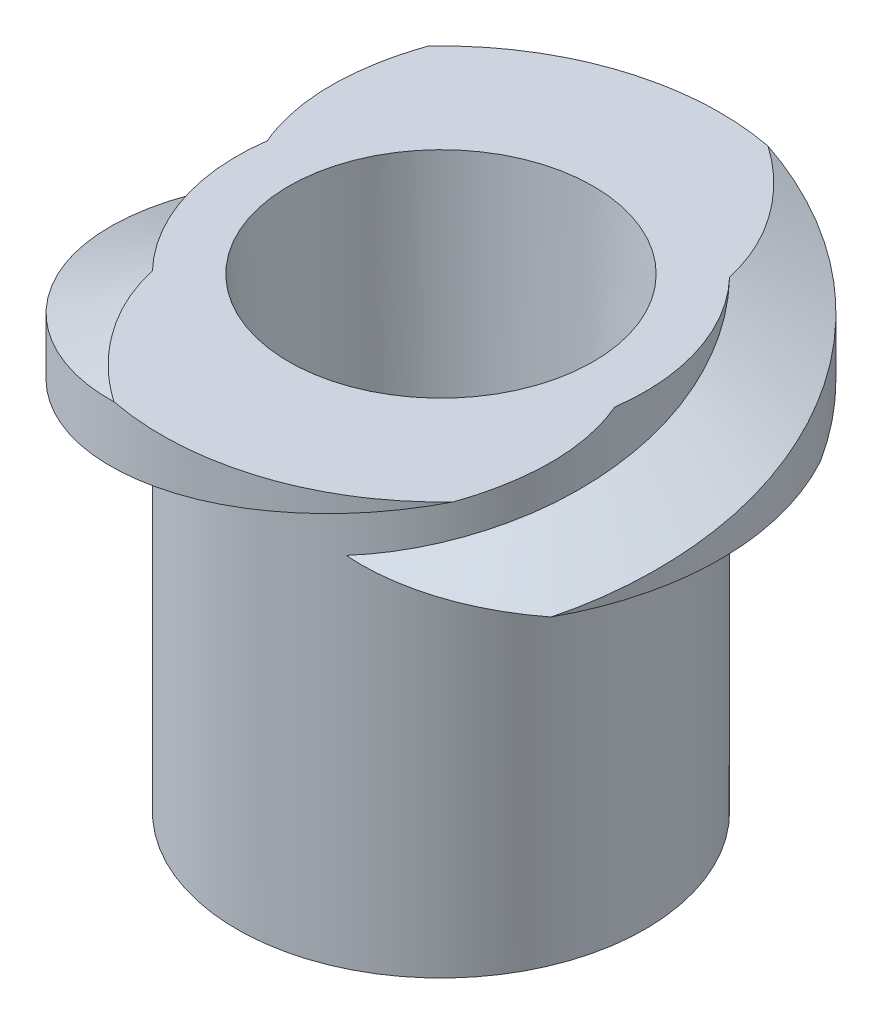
ISO-10303-21;
HEADER;
FILE_DESCRIPTION(('STEP AP214'),'2;1');
FILE_NAME('part.step','',(''),(''),'','','');
FILE_SCHEMA(('AUTOMOTIVE_DESIGN { 1 0 10303 214 1 1 1 1 }'));
ENDSEC;
DATA;
#1=APPLICATION_CONTEXT('core data for automotive mechanical design processes');
#2=APPLICATION_PROTOCOL_DEFINITION('international standard','automotive_design',2000,#1);
#3=PRODUCT_CONTEXT('',#1,'mechanical');
#4=PRODUCT('Part','Part','',(#3));
#5=PRODUCT_RELATED_PRODUCT_CATEGORY('part','',(#4));
#6=PRODUCT_DEFINITION_FORMATION('','',#4);
#7=PRODUCT_DEFINITION_CONTEXT('part definition',#1,'design');
#8=PRODUCT_DEFINITION('design','',#6,#7);
#9=PRODUCT_DEFINITION_SHAPE('','',#8);
#10=(LENGTH_UNIT() NAMED_UNIT(*) SI_UNIT(.MILLI.,.METRE.));
#11=(NAMED_UNIT(*) PLANE_ANGLE_UNIT() SI_UNIT($,.RADIAN.));
#12=(NAMED_UNIT(*) SI_UNIT($,.STERADIAN.) SOLID_ANGLE_UNIT());
#13=UNCERTAINTY_MEASURE_WITH_UNIT(LENGTH_MEASURE(1.E-05),#10,'distance_accuracy_value','');
#14=(GEOMETRIC_REPRESENTATION_CONTEXT(3) GLOBAL_UNCERTAINTY_ASSIGNED_CONTEXT((#13)) GLOBAL_UNIT_ASSIGNED_CONTEXT((#10,
#11,#12)) REPRESENTATION_CONTEXT('',''));
#15=CARTESIAN_POINT('',(0.,0.,0.));
#16=DIRECTION('',(0.,0.,1.));
#17=DIRECTION('',(1.,0.,0.));
#18=AXIS2_PLACEMENT_3D('',#15,#16,#17);
#19=CARTESIAN_POINT('',(2.75,8.43677920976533,0.));
#20=CARTESIAN_POINT('',(2.75,8.228445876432,0.736860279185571));
#21=CARTESIAN_POINT('',(2.38156986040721,8.02011254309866,1.37499999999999));
#22=CARTESIAN_POINT('',(2.01313972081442,7.81177920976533,2.0131397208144));
#23=CARTESIAN_POINT('',(1.37500000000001,7.603445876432,2.3815698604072));
#24=CARTESIAN_POINT('',(0.736860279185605,7.39511254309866,2.75));
#25=CARTESIAN_POINT('',(0.,7.18677920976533,2.75));
#26=CARTESIAN_POINT('',(-0.73686027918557,6.978445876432,2.75));
#27=CARTESIAN_POINT('',(-1.37499999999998,6.77011254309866,2.38156986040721));
#28=CARTESIAN_POINT('',(-2.0131397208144,6.56177920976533,2.01313972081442));
#29=CARTESIAN_POINT('',(-2.3815698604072,6.353445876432,1.37500000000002));
#30=CARTESIAN_POINT('',(-2.75,6.14511254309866,0.736860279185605));
#31=CARTESIAN_POINT('',(-2.75,5.93677920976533,0.));
#32=CARTESIAN_POINT('',(-2.75,5.728445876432,-0.736860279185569));
#33=CARTESIAN_POINT('',(-2.38156986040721,5.52011254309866,-1.37499999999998));
#34=CARTESIAN_POINT('',(-2.01313972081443,5.31177920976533,-2.0131397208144));
#35=CARTESIAN_POINT('',(-1.37500000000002,5.10344587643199,-2.3815698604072));
#36=CARTESIAN_POINT('',(-0.736860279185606,4.89511254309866,-2.75));
#37=CARTESIAN_POINT('',(0.,4.68677920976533,-2.75));
#38=CARTESIAN_POINT('',(0.736860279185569,4.478445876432,-2.75));
#39=CARTESIAN_POINT('',(1.37499999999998,4.27011254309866,-2.38156986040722));
#40=CARTESIAN_POINT('',(2.0131397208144,4.06177920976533,-2.01313972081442));
#41=CARTESIAN_POINT('',(2.3815698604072,3.853445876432,-1.37500000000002));
#42=CARTESIAN_POINT('',(2.75,3.64511254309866,-0.736860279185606));
#43=CARTESIAN_POINT('',(2.75,3.43677920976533,0.));
#44=CARTESIAN_POINT('',(3.9,7.90052540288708,0.));
#45=CARTESIAN_POINT('',(3.90000000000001,7.69219206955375,1.04500185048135));
#46=CARTESIAN_POINT('',(3.37749907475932,7.48385873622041,1.94999999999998));
#47=CARTESIAN_POINT('',(2.85499814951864,7.27552540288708,2.8549981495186));
#48=CARTESIAN_POINT('',(1.95000000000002,7.06719206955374,3.3774990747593));
#49=CARTESIAN_POINT('',(1.0450018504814,6.85885873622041,3.89999999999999));
#50=CARTESIAN_POINT('',(0.,6.65052540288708,3.9));
#51=CARTESIAN_POINT('',(-1.04500185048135,6.44219206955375,3.90000000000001));
#52=CARTESIAN_POINT('',(-1.94999999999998,6.23385873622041,3.37749907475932));
#53=CARTESIAN_POINT('',(-2.8549981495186,6.02552540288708,2.85499814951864));
#54=CARTESIAN_POINT('',(-3.3774990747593,5.81719206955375,1.95000000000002));
#55=CARTESIAN_POINT('',(-3.89999999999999,5.60885873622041,1.0450018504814));
#56=CARTESIAN_POINT('',(-3.9,5.40052540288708,0.));
#57=CARTESIAN_POINT('',(-3.90000000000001,5.19219206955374,-1.04500185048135));
#58=CARTESIAN_POINT('',(-3.37749907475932,4.98385873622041,-1.94999999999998));
#59=CARTESIAN_POINT('',(-2.85499814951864,4.77552540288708,-2.8549981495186));
#60=CARTESIAN_POINT('',(-1.95000000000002,4.56719206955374,-3.3774990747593));
#61=CARTESIAN_POINT('',(-1.04500185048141,4.35885873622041,-3.89999999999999));
#62=CARTESIAN_POINT('',(0.,4.15052540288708,-3.9));
#63=CARTESIAN_POINT('',(1.04500185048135,3.94219206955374,-3.90000000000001));
#64=CARTESIAN_POINT('',(1.94999999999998,3.73385873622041,-3.37749907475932));
#65=CARTESIAN_POINT('',(2.8549981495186,3.52552540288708,-2.85499814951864));
#66=CARTESIAN_POINT('',(3.3774990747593,3.31719206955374,-1.95000000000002));
#67=CARTESIAN_POINT('',(3.89999999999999,3.10885873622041,-1.04500185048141));
#68=CARTESIAN_POINT('',(3.9,2.90052540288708,0.));
#69=(BOUNDED_SURFACE() B_SPLINE_SURFACE(1,2,((#19,#20,#21,#22,#23,#24,#25,#26,#27,#28,#29,#30,
#31,#32,#33,#34,#35,#36,#37,#38,#39,#40,#41,#42,#43),(#44,#45,#46,#47,#48,#49,#50,#51,#52,#53,
#54,#55,#56,#57,#58,#59,#60,#61,#62,#63,#64,#65,#66,#67,#68)),.UNSPECIFIED.,.F.,.F.,
.F.) B_SPLINE_SURFACE_WITH_KNOTS((2,2),(3,2,2,2,2,2,2,2,2,2,2,2,3),(0.,1.),(0.,
0.0833333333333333,0.166666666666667,0.25,0.333333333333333,0.416666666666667,0.5,
0.583333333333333,0.666666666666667,0.75,0.833333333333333,0.916666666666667,1.),
.UNSPECIFIED.) GEOMETRIC_REPRESENTATION_ITEM() RATIONAL_B_SPLINE_SURFACE(((1.,0.965925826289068,
1.,0.965925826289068,1.,0.965925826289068,1.,0.965925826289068,1.,0.965925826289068,1.,
0.965925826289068,1.,0.965925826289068,1.,0.965925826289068,1.,0.965925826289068,1.,
0.965925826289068,1.,0.965925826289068,1.,0.965925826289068,1.),(1.,0.965925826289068,1.,
0.965925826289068,1.,0.965925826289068,1.,0.965925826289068,1.,0.965925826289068,1.,
0.965925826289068,1.,0.965925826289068,1.,0.965925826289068,1.,0.965925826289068,1.,
0.965925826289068,1.,0.965925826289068,1.,0.965925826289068,1.))) REPRESENTATION_ITEM('') SURFACE());
#70=CARTESIAN_POINT('',(2.85,8.39014844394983,0.));
#71=CARTESIAN_POINT('',(2.85,8.1818151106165,0.763655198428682));
#72=CARTESIAN_POINT('',(2.46817240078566,7.97348177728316,1.42499999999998));
#73=CARTESIAN_POINT('',(2.08634480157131,7.76514844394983,2.08634480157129));
#74=CARTESIAN_POINT('',(1.42500000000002,7.55681511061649,2.46817240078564));
#75=CARTESIAN_POINT('',(0.763655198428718,7.34848177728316,2.85));
#76=CARTESIAN_POINT('',(0.,7.14014844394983,2.85));
#77=CARTESIAN_POINT('',(-0.763655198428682,6.9318151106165,2.85));
#78=CARTESIAN_POINT('',(-1.42499999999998,6.72348177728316,2.46817240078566));
#79=CARTESIAN_POINT('',(-2.08634480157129,6.51514844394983,2.08634480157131));
#80=CARTESIAN_POINT('',(-2.46817240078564,6.30681511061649,1.42500000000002));
#81=CARTESIAN_POINT('',(-2.85,6.09848177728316,0.763655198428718));
#82=CARTESIAN_POINT('',(-2.85,5.89014844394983,0.));
#83=CARTESIAN_POINT('',(-2.85,5.6818151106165,-0.763655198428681));
#84=CARTESIAN_POINT('',(-2.46817240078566,5.47348177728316,-1.42499999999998));
#85=CARTESIAN_POINT('',(-2.08634480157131,5.26514844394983,-2.08634480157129));
#86=CARTESIAN_POINT('',(-1.42500000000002,5.05681511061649,-2.46817240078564));
#87=CARTESIAN_POINT('',(-0.763655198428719,4.84848177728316,-2.85));
#88=CARTESIAN_POINT('',(0.,4.64014844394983,-2.85));
#89=CARTESIAN_POINT('',(0.763655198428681,4.43181511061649,-2.85));
#90=CARTESIAN_POINT('',(1.42499999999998,4.22348177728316,-2.46817240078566));
#91=CARTESIAN_POINT('',(2.08634480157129,4.01514844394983,-2.08634480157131));
#92=CARTESIAN_POINT('',(2.46817240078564,3.80681511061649,-1.42500000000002));
#93=CARTESIAN_POINT('',(2.85,3.59848177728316,-0.76365519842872));
#94=CARTESIAN_POINT('',(2.85,3.39014844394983,0.));
#95=(BOUNDED_CURVE() B_SPLINE_CURVE(2,(#70,#71,#72,#73,#74,#75,#76,#77,#78,#79,#80,#81,#82,#83,
#84,#85,#86,#87,#88,#89,#90,#91,#92,#93,#94),.UNSPECIFIED.,.F.,
.F.) B_SPLINE_CURVE_WITH_KNOTS((3,2,2,2,2,2,2,2,2,2,2,2,3),(0.,0.0833333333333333,
0.166666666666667,0.25,0.333333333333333,0.416666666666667,0.5,0.583333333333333,
0.666666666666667,0.75,0.833333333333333,0.916666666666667,1.),
.UNSPECIFIED.) CURVE() GEOMETRIC_REPRESENTATION_ITEM() RATIONAL_B_SPLINE_CURVE((1.,
0.965925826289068,1.,0.965925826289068,1.,0.965925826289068,1.,0.965925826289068,1.,
0.965925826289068,1.,0.965925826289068,1.,0.965925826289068,1.,0.965925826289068,1.,
0.965925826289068,1.,0.965925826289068,1.,0.965925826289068,1.,0.965925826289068,1.)) REPRESENTATION_ITEM(''));
#96=CARTESIAN_POINT('',(-2.05282327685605,6.5,1.9769715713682));
#97=VERTEX_POINT('',#96);
#98=CARTESIAN_POINT('',(-1.24264054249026,5.,-2.56482835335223));
#99=VERTEX_POINT('',#98);
#100=EDGE_CURVE('E125',#97,#99,#95,.T.);
#101=CARTESIAN_POINT('',(-1.24264054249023,4.99999999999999,-2.56482835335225));
#102=CARTESIAN_POINT('',(-1.2624212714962,4.99999999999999,-2.56652366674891));
#103=CARTESIAN_POINT('',(-1.28222241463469,5.,-2.56797893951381));
#104=CARTESIAN_POINT('',(-1.32185293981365,5.,-2.57041309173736));
#105=CARTESIAN_POINT('',(-1.34168232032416,5.,-2.57139199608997));
#106=CARTESIAN_POINT('',(-1.38135136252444,5.,-2.5728769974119));
#107=CARTESIAN_POINT('',(-1.40119101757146,5.,-2.57338327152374));
#108=CARTESIAN_POINT('',(-1.4408768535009,5.,-2.5739164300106));
#109=CARTESIAN_POINT('',(-1.46072303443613,5.,-2.5739433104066));
#110=CARTESIAN_POINT('',(-1.50039927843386,5.,-2.57355572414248));
#111=CARTESIAN_POINT('',(-1.52022934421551,5.,-2.57314151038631));
#112=CARTESIAN_POINT('',(-1.55987782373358,5.,-2.57193758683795));
#113=CARTESIAN_POINT('',(-1.57969623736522,5.,-2.57114787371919));
#114=CARTESIAN_POINT('',(-1.63912738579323,5.,-2.56819439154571));
#115=CARTESIAN_POINT('',(-1.6787127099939,5.,-2.56544631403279));
#116=CARTESIAN_POINT('',(-1.75767869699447,5.,-2.55842355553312));
#117=CARTESIAN_POINT('',(-1.79705959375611,5.,-2.55415148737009));
#118=CARTESIAN_POINT('',(-1.8756229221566,5.,-2.54409351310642));
#119=CARTESIAN_POINT('',(-1.91480536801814,5.,-2.53830771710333));
#120=CARTESIAN_POINT('',(-2.03198884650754,5.,-2.51870417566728));
#121=CARTESIAN_POINT('',(-2.10962517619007,5.,-2.50264035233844));
#122=CARTESIAN_POINT('',(-2.2655404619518,5.,-2.46417697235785));
#123=CARTESIAN_POINT('',(-2.34377993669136,5.,-2.4416176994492));
#124=CARTESIAN_POINT('',(-2.49828325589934,5.,-2.39058652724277));
#125=CARTESIAN_POINT('',(-2.57454703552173,5.,-2.36211443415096));
#126=CARTESIAN_POINT('',(-2.79971506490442,5.,-2.26816813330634));
#127=CARTESIAN_POINT('',(-2.94518456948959,5.,-2.194116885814));
#128=CARTESIAN_POINT('',(-3.14205673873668,5.,-2.07487944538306));
#129=CARTESIAN_POINT('',(-3.19876057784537,5.,-2.038107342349));
#130=CARTESIAN_POINT('',(-3.28201449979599,5.,-1.9804475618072));
#131=CARTESIAN_POINT('',(-3.30944025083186,5.,-1.96083055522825));
#132=CARTESIAN_POINT('',(-3.35013459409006,5.,-1.93080148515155));
#133=CARTESIAN_POINT('',(-3.36362663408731,5.,-1.92069017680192));
#134=CARTESIAN_POINT('',(-3.390479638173,5.,-1.90029597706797));
#135=CARTESIAN_POINT('',(-3.4038406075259,5.,-1.89001309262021));
#136=CARTESIAN_POINT('',(-3.41714556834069,5.,-1.8796585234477));
#137=B_SPLINE_CURVE_WITH_KNOTS('',3,(#101,#102,#103,#104,#105,#106,#107,#108,#109,#110,#111,
#112,#113,#114,#115,#116,#117,#118,#119,#120,#121,#122,#123,#124,#125,#126,#127,#128,#129,#130,
#131,#132,#133,#134,#135,#136),.UNSPECIFIED.,.F.,.F.,(4,2,2,2,2,2,2,2,2,2,2,2,2,2,2,2,2,4),(0.,
0.0595580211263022,0.119112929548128,0.178645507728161,0.238178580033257,0.297677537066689,
0.357177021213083,0.476185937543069,0.594991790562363,0.71378900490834,0.951385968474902,
1.19541378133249,1.4394495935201,1.9269438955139,2.12960909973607,2.23074934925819,
2.2813294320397,2.33190747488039),.UNSPECIFIED.);
#138=CARTESIAN_POINT('',(-3.41714556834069,5.,-1.87965852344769));
#139=VERTEX_POINT('',#138);
#140=EDGE_CURVE('E276',#99,#139,#137,.T.);
#141=CARTESIAN_POINT('',(3.9,7.90052540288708,0.));
#142=CARTESIAN_POINT('',(3.90000000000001,7.69219206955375,1.04500185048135));
#143=CARTESIAN_POINT('',(3.37749907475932,7.48385873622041,1.94999999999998));
#144=CARTESIAN_POINT('',(2.85499814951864,7.27552540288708,2.8549981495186));
#145=CARTESIAN_POINT('',(1.95000000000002,7.06719206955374,3.3774990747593));
#146=CARTESIAN_POINT('',(1.0450018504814,6.85885873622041,3.89999999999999));
#147=CARTESIAN_POINT('',(0.,6.65052540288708,3.9));
#148=CARTESIAN_POINT('',(-1.04500185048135,6.44219206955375,3.90000000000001));
#149=CARTESIAN_POINT('',(-1.94999999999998,6.23385873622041,3.37749907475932));
#150=CARTESIAN_POINT('',(-2.8549981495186,6.02552540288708,2.85499814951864));
#151=CARTESIAN_POINT('',(-3.3774990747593,5.81719206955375,1.95000000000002));
#152=CARTESIAN_POINT('',(-3.89999999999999,5.60885873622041,1.0450018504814));
#153=CARTESIAN_POINT('',(-3.9,5.40052540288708,0.));
#154=CARTESIAN_POINT('',(-3.90000000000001,5.19219206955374,-1.04500185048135));
#155=CARTESIAN_POINT('',(-3.37749907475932,4.98385873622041,-1.94999999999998));
#156=CARTESIAN_POINT('',(-2.85499814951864,4.77552540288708,-2.8549981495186));
#157=CARTESIAN_POINT('',(-1.95000000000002,4.56719206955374,-3.3774990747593));
#158=CARTESIAN_POINT('',(-1.04500185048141,4.35885873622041,-3.89999999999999));
#159=CARTESIAN_POINT('',(0.,4.15052540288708,-3.9));
#160=CARTESIAN_POINT('',(1.04500185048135,3.94219206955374,-3.90000000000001));
#161=CARTESIAN_POINT('',(1.94999999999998,3.73385873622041,-3.37749907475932));
#162=CARTESIAN_POINT('',(2.8549981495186,3.52552540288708,-2.85499814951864));
#163=CARTESIAN_POINT('',(3.3774990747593,3.31719206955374,-1.95000000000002));
#164=CARTESIAN_POINT('',(3.89999999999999,3.10885873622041,-1.04500185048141));
#165=CARTESIAN_POINT('',(3.9,2.90052540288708,0.));
#166=(BOUNDED_CURVE() B_SPLINE_CURVE(2,(#141,#142,#143,#144,#145,#146,#147,#148,#149,#150,#151,
#152,#153,#154,#155,#156,#157,#158,#159,#160,#161,#162,#163,#164,#165),.UNSPECIFIED.,.F.,
.F.) B_SPLINE_CURVE_WITH_KNOTS((3,2,2,2,2,2,2,2,2,2,2,2,3),(0.,0.0833333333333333,
0.166666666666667,0.25,0.333333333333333,0.416666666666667,0.5,0.583333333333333,
0.666666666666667,0.75,0.833333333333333,0.916666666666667,1.),
.UNSPECIFIED.) CURVE() GEOMETRIC_REPRESENTATION_ITEM() RATIONAL_B_SPLINE_CURVE((1.,
0.965925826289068,1.,0.965925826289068,1.,0.965925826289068,1.,0.965925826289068,1.,
0.965925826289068,1.,0.965925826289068,1.,0.965925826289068,1.,0.965925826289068,1.,
0.965925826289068,1.,0.965925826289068,1.,0.965925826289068,1.,0.965925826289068,1.)) REPRESENTATION_ITEM(''));
#167=CARTESIAN_POINT('',(-0.736246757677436,6.49999999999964,3.82987476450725));
#168=VERTEX_POINT('',#167);
#169=EDGE_CURVE('E168',#168,#139,#166,.T.);
#170=CARTESIAN_POINT('',(-2.08805214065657,6.5,1.78956370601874));
#171=CARTESIAN_POINT('',(-2.0768315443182,6.5,1.86417552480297));
#172=CARTESIAN_POINT('',(-2.06235445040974,6.5,1.93828609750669));
#173=CARTESIAN_POINT('',(-2.02714168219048,6.5,2.08501028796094));
#174=CARTESIAN_POINT('',(-2.00640575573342,6.5,2.15762384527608));
#175=CARTESIAN_POINT('',(-1.95911273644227,6.5,2.30030420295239));
#176=CARTESIAN_POINT('',(-1.93260150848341,6.5,2.37038626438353));
#177=CARTESIAN_POINT('',(-1.87395034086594,6.5,2.50814391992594));
#178=CARTESIAN_POINT('',(-1.84181161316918,6.5,2.57582002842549));
#179=CARTESIAN_POINT('',(-1.789497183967,6.5,2.67543898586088));
#180=CARTESIAN_POINT('',(-1.77130515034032,6.5,2.70843927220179));
#181=CARTESIAN_POINT('',(-1.73361506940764,6.5,2.77368639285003));
#182=CARTESIAN_POINT('',(-1.71411709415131,6.5,2.80593326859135));
#183=CARTESIAN_POINT('',(-1.6738341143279,6.5,2.86961915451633));
#184=CARTESIAN_POINT('',(-1.65304884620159,6.5,2.90105799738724));
#185=CARTESIAN_POINT('',(-1.61046737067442,6.5,2.96324792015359));
#186=CARTESIAN_POINT('',(-1.58867097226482,6.5,2.99399886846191));
#187=CARTESIAN_POINT('',(-1.52166268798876,6.5,3.08528981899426));
#188=CARTESIAN_POINT('',(-1.47492454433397,6.5,3.14472209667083));
#189=CARTESIAN_POINT('',(-1.37766083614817,6.5,3.2603902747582));
#190=CARTESIAN_POINT('',(-1.32713502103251,6.5,3.31662596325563));
#191=CARTESIAN_POINT('',(-1.192870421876,6.5,3.45660789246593));
#192=CARTESIAN_POINT('',(-1.1065350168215,6.5,3.53788605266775));
#193=CARTESIAN_POINT('',(-0.926621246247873,6.5,3.6909838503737));
#194=CARTESIAN_POINT('',(-0.833082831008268,6.5,3.76285042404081));
#195=CARTESIAN_POINT('',(-0.736246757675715,6.5,3.82987476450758));
#196=B_SPLINE_CURVE_WITH_KNOTS('',3,(#170,#171,#172,#173,#174,#175,#176,#177,#178,#179,#180,
#181,#182,#183,#184,#185,#186,#187,#188,#189,#190,#191,#192,#193,#194,#195),.UNSPECIFIED.,.F.,
.F.,(4,2,2,2,2,2,2,2,2,2,2,2,4),(0.,0.226265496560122,0.452540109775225,0.677079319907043,
0.901570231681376,1.014593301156,1.12761014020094,1.24065019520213,1.35371169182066,
1.58035229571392,1.80700790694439,2.16209850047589,2.51534470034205),.UNSPECIFIED.);
#197=EDGE_CURVE('E52',#97,#168,#196,.T.);
#198=ORIENTED_EDGE('',*,*,#100,.T.);
#199=ORIENTED_EDGE('',*,*,#140,.T.);
#200=ORIENTED_EDGE('',*,*,#169,.F.);
#201=ORIENTED_EDGE('',*,*,#197,.F.);
#202=EDGE_LOOP('',(#198,#199,#200,#201));
#203=FACE_BOUND('',#202,.T.);
#204=ADVANCED_FACE('F32',(#203),#69,.F.);
#205=CARTESIAN_POINT('',(3.9,7.09947459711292,0.));
#206=CARTESIAN_POINT('',(3.90000000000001,6.89114126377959,1.04500185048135));
#207=CARTESIAN_POINT('',(3.37749907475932,6.68280793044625,1.94999999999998));
#208=CARTESIAN_POINT('',(2.85499814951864,6.47447459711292,2.8549981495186));
#209=CARTESIAN_POINT('',(1.95000000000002,6.26614126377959,3.3774990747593));
#210=CARTESIAN_POINT('',(1.0450018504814,6.05780793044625,3.89999999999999));
#211=CARTESIAN_POINT('',(0.,5.84947459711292,3.9));
#212=CARTESIAN_POINT('',(-1.04500185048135,5.64114126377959,3.90000000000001));
#213=CARTESIAN_POINT('',(-1.94999999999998,5.43280793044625,3.37749907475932));
#214=CARTESIAN_POINT('',(-2.8549981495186,5.22447459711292,2.85499814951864));
#215=CARTESIAN_POINT('',(-3.3774990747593,5.01614126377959,1.95000000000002));
#216=CARTESIAN_POINT('',(-3.89999999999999,4.80780793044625,1.0450018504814));
#217=CARTESIAN_POINT('',(-3.9,4.59947459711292,0.));
#218=CARTESIAN_POINT('',(-3.90000000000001,4.39114126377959,-1.04500185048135));
#219=CARTESIAN_POINT('',(-3.37749907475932,4.18280793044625,-1.94999999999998));
#220=CARTESIAN_POINT('',(-2.85499814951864,3.97447459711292,-2.8549981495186));
#221=CARTESIAN_POINT('',(-1.95000000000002,3.76614126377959,-3.3774990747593));
#222=CARTESIAN_POINT('',(-1.04500185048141,3.55780793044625,-3.89999999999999));
#223=CARTESIAN_POINT('',(0.,3.34947459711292,-3.9));
#224=CARTESIAN_POINT('',(1.04500185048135,3.14114126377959,-3.90000000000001));
#225=CARTESIAN_POINT('',(1.94999999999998,2.93280793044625,-3.37749907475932));
#226=CARTESIAN_POINT('',(2.8549981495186,2.72447459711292,-2.85499814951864));
#227=CARTESIAN_POINT('',(3.3774990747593,2.51614126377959,-1.95000000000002));
#228=CARTESIAN_POINT('',(3.89999999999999,2.30780793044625,-1.04500185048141));
#229=CARTESIAN_POINT('',(3.9,2.09947459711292,0.));
#230=CARTESIAN_POINT('',(2.75,6.56322079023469,0.));
#231=CARTESIAN_POINT('',(2.75,6.35488745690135,0.736860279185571));
#232=CARTESIAN_POINT('',(2.38156986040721,6.14655412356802,1.37499999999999));
#233=CARTESIAN_POINT('',(2.01313972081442,5.93822079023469,2.0131397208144));
#234=CARTESIAN_POINT('',(1.37500000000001,5.72988745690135,2.3815698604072));
#235=CARTESIAN_POINT('',(0.736860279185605,5.52155412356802,2.75));
#236=CARTESIAN_POINT('',(0.,5.31322079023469,2.75));
#237=CARTESIAN_POINT('',(-0.73686027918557,5.10488745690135,2.75));
#238=CARTESIAN_POINT('',(-1.37499999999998,4.89655412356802,2.38156986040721));
#239=CARTESIAN_POINT('',(-2.0131397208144,4.68822079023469,2.01313972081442));
#240=CARTESIAN_POINT('',(-2.3815698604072,4.47988745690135,1.37500000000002));
#241=CARTESIAN_POINT('',(-2.75,4.27155412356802,0.736860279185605));
#242=CARTESIAN_POINT('',(-2.75,4.06322079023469,0.));
#243=CARTESIAN_POINT('',(-2.75,3.85488745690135,-0.736860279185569));
#244=CARTESIAN_POINT('',(-2.38156986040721,3.64655412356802,-1.37499999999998));
#245=CARTESIAN_POINT('',(-2.01313972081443,3.43822079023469,-2.0131397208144));
#246=CARTESIAN_POINT('',(-1.37500000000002,3.22988745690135,-2.3815698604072));
#247=CARTESIAN_POINT('',(-0.736860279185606,3.02155412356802,-2.75));
#248=CARTESIAN_POINT('',(0.,2.81322079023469,-2.75));
#249=CARTESIAN_POINT('',(0.736860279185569,2.60488745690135,-2.75));
#250=CARTESIAN_POINT('',(1.37499999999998,2.39655412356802,-2.38156986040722));
#251=CARTESIAN_POINT('',(2.0131397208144,2.18822079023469,-2.01313972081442));
#252=CARTESIAN_POINT('',(2.3815698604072,1.97988745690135,-1.37500000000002));
#253=CARTESIAN_POINT('',(2.75,1.77155412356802,-0.736860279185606));
#254=CARTESIAN_POINT('',(2.75,1.56322079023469,0.));
#255=(BOUNDED_SURFACE() B_SPLINE_SURFACE(1,2,((#205,#206,#207,#208,#209,#210,#211,#212,#213,
#214,#215,#216,#217,#218,#219,#220,#221,#222,#223,#224,#225,#226,#227,#228,#229),(#230,#231,
#232,#233,#234,#235,#236,#237,#238,#239,#240,#241,#242,#243,#244,#245,#246,#247,#248,#249,#250,
#251,#252,#253,#254)),.UNSPECIFIED.,.F.,.F.,.F.) B_SPLINE_SURFACE_WITH_KNOTS((2,2),(3,2,2,2,2,2,
2,2,2,2,2,2,3),(0.,1.),(0.,0.0833333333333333,0.166666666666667,0.25,0.333333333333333,
0.416666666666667,0.5,0.583333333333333,0.666666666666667,0.75,0.833333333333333,
0.916666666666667,1.),
.UNSPECIFIED.) GEOMETRIC_REPRESENTATION_ITEM() RATIONAL_B_SPLINE_SURFACE(((1.,0.965925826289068,
1.,0.965925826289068,1.,0.965925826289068,1.,0.965925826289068,1.,0.965925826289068,1.,
0.965925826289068,1.,0.965925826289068,1.,0.965925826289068,1.,0.965925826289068,1.,
0.965925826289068,1.,0.965925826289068,1.,0.965925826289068,1.),(1.,0.965925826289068,1.,
0.965925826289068,1.,0.965925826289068,1.,0.965925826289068,1.,0.965925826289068,1.,
0.965925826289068,1.,0.965925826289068,1.,0.965925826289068,1.,0.965925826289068,1.,
0.965925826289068,1.,0.965925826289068,1.,0.965925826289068,1.))) REPRESENTATION_ITEM('') SURFACE());
#256=CARTESIAN_POINT('',(3.9,7.09947459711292,0.));
#257=CARTESIAN_POINT('',(3.90000000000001,6.89114126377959,1.04500185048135));
#258=CARTESIAN_POINT('',(3.37749907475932,6.68280793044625,1.94999999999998));
#259=CARTESIAN_POINT('',(2.85499814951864,6.47447459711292,2.8549981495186));
#260=CARTESIAN_POINT('',(1.95000000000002,6.26614126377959,3.3774990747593));
#261=CARTESIAN_POINT('',(1.0450018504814,6.05780793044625,3.89999999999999));
#262=CARTESIAN_POINT('',(0.,5.84947459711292,3.9));
#263=CARTESIAN_POINT('',(-1.04500185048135,5.64114126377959,3.90000000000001));
#264=CARTESIAN_POINT('',(-1.94999999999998,5.43280793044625,3.37749907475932));
#265=CARTESIAN_POINT('',(-2.8549981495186,5.22447459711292,2.85499814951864));
#266=CARTESIAN_POINT('',(-3.3774990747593,5.01614126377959,1.95000000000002));
#267=CARTESIAN_POINT('',(-3.89999999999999,4.80780793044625,1.0450018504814));
#268=CARTESIAN_POINT('',(-3.9,4.59947459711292,0.));
#269=CARTESIAN_POINT('',(-3.90000000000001,4.39114126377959,-1.04500185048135));
#270=CARTESIAN_POINT('',(-3.37749907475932,4.18280793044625,-1.94999999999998));
#271=CARTESIAN_POINT('',(-2.85499814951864,3.97447459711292,-2.8549981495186));
#272=CARTESIAN_POINT('',(-1.95000000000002,3.76614126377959,-3.3774990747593));
#273=CARTESIAN_POINT('',(-1.04500185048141,3.55780793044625,-3.89999999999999));
#274=CARTESIAN_POINT('',(0.,3.34947459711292,-3.9));
#275=CARTESIAN_POINT('',(1.04500185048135,3.14114126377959,-3.90000000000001));
#276=CARTESIAN_POINT('',(1.94999999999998,2.93280793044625,-3.37749907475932));
#277=CARTESIAN_POINT('',(2.8549981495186,2.72447459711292,-2.85499814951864));
#278=CARTESIAN_POINT('',(3.3774990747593,2.51614126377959,-1.95000000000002));
#279=CARTESIAN_POINT('',(3.89999999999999,2.30780793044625,-1.04500185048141));
#280=CARTESIAN_POINT('',(3.9,2.09947459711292,0.));
#281=(BOUNDED_CURVE() B_SPLINE_CURVE(2,(#256,#257,#258,#259,#260,#261,#262,#263,#264,#265,#266,
#267,#268,#269,#270,#271,#272,#273,#274,#275,#276,#277,#278,#279,#280),.UNSPECIFIED.,.F.,
.F.) B_SPLINE_CURVE_WITH_KNOTS((3,2,2,2,2,2,2,2,2,2,2,2,3),(0.,0.0833333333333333,
0.166666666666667,0.25,0.333333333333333,0.416666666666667,0.5,0.583333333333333,
0.666666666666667,0.75,0.833333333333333,0.916666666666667,1.),
.UNSPECIFIED.) CURVE() GEOMETRIC_REPRESENTATION_ITEM() RATIONAL_B_SPLINE_CURVE((1.,
0.965925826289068,1.,0.965925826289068,1.,0.965925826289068,1.,0.965925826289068,1.,
0.965925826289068,1.,0.965925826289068,1.,0.965925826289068,1.,0.965925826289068,1.,
0.965925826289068,1.,0.965925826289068,1.,0.965925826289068,1.,0.965925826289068,1.)) REPRESENTATION_ITEM(''));
#282=CARTESIAN_POINT('',(2.84377950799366,6.5,2.66887956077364));
#283=VERTEX_POINT('',#282);
#284=CARTESIAN_POINT('',(-3.41714556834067,5.,1.87965852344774));
#285=VERTEX_POINT('',#284);
#286=EDGE_CURVE('E173',#283,#285,#281,.T.);
#287=CARTESIAN_POINT('',(-3.41714556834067,5.,1.87965852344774));
#288=CARTESIAN_POINT('',(-3.39841788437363,5.,1.89424025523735));
#289=CARTESIAN_POINT('',(-3.37957089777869,5.,1.90867092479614));
#290=CARTESIAN_POINT('',(-3.3416084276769,5.,1.93717292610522));
#291=CARTESIAN_POINT('',(-3.32249295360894,5.,1.95124427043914));
#292=CARTESIAN_POINT('',(-3.26471073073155,5.,1.99282513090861));
#293=CARTESIAN_POINT('',(-3.22559486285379,5.,2.01971195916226));
#294=CARTESIAN_POINT('',(-3.10651854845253,5.,2.09786824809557));
#295=CARTESIAN_POINT('',(-3.02487121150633,5.,2.14660064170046));
#296=CARTESIAN_POINT('',(-2.85717761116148,5.,2.23704483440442));
#297=CARTESIAN_POINT('',(-2.77110869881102,5.,2.27871453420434));
#298=CARTESIAN_POINT('',(-2.59561877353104,5.,2.35426652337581));
#299=CARTESIAN_POINT('',(-2.50619817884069,5.,2.38814978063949));
#300=CARTESIAN_POINT('',(-2.33634851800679,5.,2.44390708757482));
#301=CARTESIAN_POINT('',(-2.25624044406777,5.,2.46676480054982));
#302=CARTESIAN_POINT('',(-2.0944228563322,5.,2.50605336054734));
#303=CARTESIAN_POINT('',(-2.01271289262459,5.,2.52248237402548));
#304=CARTESIAN_POINT('',(-1.88954960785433,5.,2.54211956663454));
#305=CARTESIAN_POINT('',(-1.84847950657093,5.,2.5478243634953));
#306=CARTESIAN_POINT('',(-1.76613590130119,5.,2.55757499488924));
#307=CARTESIAN_POINT('',(-1.72486238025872,5.,2.56162068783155));
#308=CARTESIAN_POINT('',(-1.64221611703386,5.,2.56801492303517));
#309=CARTESIAN_POINT('',(-1.60084346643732,5.,2.57036467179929));
#310=CARTESIAN_POINT('',(-1.51804162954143,5.,2.57342062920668));
#311=CARTESIAN_POINT('',(-1.47661245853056,5.,2.57412721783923));
#312=CARTESIAN_POINT('',(-1.41912326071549,5.,2.57367526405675));
#313=CARTESIAN_POINT('',(-1.40305504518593,5.,2.57339356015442));
#314=CARTESIAN_POINT('',(-1.37092909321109,5.,2.57252038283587));
#315=CARTESIAN_POINT('',(-1.35487135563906,5.,2.57192895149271));
#316=CARTESIAN_POINT('',(-1.3227736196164,5.,2.5704348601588));
#317=CARTESIAN_POINT('',(-1.3067336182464,5.,2.56953226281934));
#318=CARTESIAN_POINT('',(-1.27467146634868,5.,2.56741477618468));
#319=CARTESIAN_POINT('',(-1.25864931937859,5.,2.56619983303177));
#320=CARTESIAN_POINT('',(-1.24264054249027,5.,2.56482835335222));
#321=B_SPLINE_CURVE_WITH_KNOTS('',3,(#287,#288,#289,#290,#291,#292,#293,#294,#295,#296,#297,
#298,#299,#300,#301,#302,#303,#304,#305,#306,#307,#308,#309,#310,#311,#312,#313,#314,#315,#316,
#317,#318,#319,#320),.UNSPECIFIED.,.F.,.F.,(4,2,2,2,2,2,2,2,2,2,2,2,2,2,2,2,4),(0.,
0.0712064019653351,0.142410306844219,0.284767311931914,0.569640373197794,0.856155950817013,
1.14263589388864,1.39230585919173,1.64204698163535,1.76641317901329,1.89078998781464,
2.01507822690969,2.13933772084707,2.18754706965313,2.23574987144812,2.28394297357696,
2.33214439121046),.UNSPECIFIED.);
#322=CARTESIAN_POINT('',(-1.24264054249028,5.,2.56482835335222));
#323=VERTEX_POINT('',#322);
#324=EDGE_CURVE('E270',#285,#323,#321,.T.);
#325=CARTESIAN_POINT('',(2.85,6.60985155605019,0.));
#326=CARTESIAN_POINT('',(2.85,6.40151822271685,0.763655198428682));
#327=CARTESIAN_POINT('',(2.46817240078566,6.19318488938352,1.42499999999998));
#328=CARTESIAN_POINT('',(2.08634480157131,5.98485155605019,2.08634480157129));
#329=CARTESIAN_POINT('',(1.42500000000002,5.77651822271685,2.46817240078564));
#330=CARTESIAN_POINT('',(0.763655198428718,5.56818488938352,2.84999999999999));
#331=CARTESIAN_POINT('',(0.,5.35985155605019,2.85));
#332=CARTESIAN_POINT('',(-0.763655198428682,5.15151822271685,2.85));
#333=CARTESIAN_POINT('',(-1.42499999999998,4.94318488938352,2.46817240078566));
#334=CARTESIAN_POINT('',(-2.08634480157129,4.73485155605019,2.08634480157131));
#335=CARTESIAN_POINT('',(-2.46817240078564,4.52651822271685,1.42500000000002));
#336=CARTESIAN_POINT('',(-2.84999999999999,4.31818488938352,0.763655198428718));
#337=CARTESIAN_POINT('',(-2.85,4.10985155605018,0.));
#338=CARTESIAN_POINT('',(-2.85,3.90151822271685,-0.763655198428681));
#339=CARTESIAN_POINT('',(-2.46817240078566,3.69318488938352,-1.42499999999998));
#340=CARTESIAN_POINT('',(-2.08634480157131,3.48485155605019,-2.08634480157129));
#341=CARTESIAN_POINT('',(-1.42500000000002,3.27651822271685,-2.46817240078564));
#342=CARTESIAN_POINT('',(-0.763655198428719,3.06818488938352,-2.84999999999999));
#343=CARTESIAN_POINT('',(0.,2.85985155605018,-2.85));
#344=CARTESIAN_POINT('',(0.763655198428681,2.65151822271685,-2.85));
#345=CARTESIAN_POINT('',(1.42499999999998,2.44318488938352,-2.46817240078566));
#346=CARTESIAN_POINT('',(2.08634480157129,2.23485155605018,-2.08634480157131));
#347=CARTESIAN_POINT('',(2.46817240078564,2.02651822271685,-1.42500000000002));
#348=CARTESIAN_POINT('',(2.84999999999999,1.81818488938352,-0.76365519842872));
#349=CARTESIAN_POINT('',(2.85,1.60985155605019,0.));
#350=(BOUNDED_CURVE() B_SPLINE_CURVE(2,(#325,#326,#327,#328,#329,#330,#331,#332,#333,#334,#335,
#336,#337,#338,#339,#340,#341,#342,#343,#344,#345,#346,#347,#348,#349),.UNSPECIFIED.,.F.,
.F.) B_SPLINE_CURVE_WITH_KNOTS((3,2,2,2,2,2,2,2,2,2,2,2,3),(0.,0.0833333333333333,
0.166666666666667,0.25,0.333333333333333,0.416666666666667,0.5,0.583333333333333,
0.666666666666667,0.75,0.833333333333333,0.916666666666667,1.),
.UNSPECIFIED.) CURVE() GEOMETRIC_REPRESENTATION_ITEM() RATIONAL_B_SPLINE_CURVE((1.,
0.965925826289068,1.,0.965925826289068,1.,0.965925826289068,1.,0.965925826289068,1.,
0.965925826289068,1.,0.965925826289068,1.,0.965925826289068,1.,0.965925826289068,1.,
0.965925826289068,1.,0.965925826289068,1.,0.965925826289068,1.,0.965925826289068,1.)) REPRESENTATION_ITEM(''));
#351=CARTESIAN_POINT('',(2.8224545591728,6.5,0.395285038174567));
#352=VERTEX_POINT('',#351);
#353=EDGE_CURVE('E128',#323,#352,#350,.F.);
#354=CARTESIAN_POINT('',(2.84377950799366,6.5,2.66887956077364));
#355=CARTESIAN_POINT('',(2.86079498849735,6.5,2.62034372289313));
#356=CARTESIAN_POINT('',(2.87679778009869,6.5,2.57145247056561));
#357=CARTESIAN_POINT('',(2.90674110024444,6.5,2.47304555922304));
#358=CARTESIAN_POINT('',(2.92068174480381,6.5,2.42352993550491));
#359=CARTESIAN_POINT('',(2.94650192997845,6.5,2.32381572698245));
#360=CARTESIAN_POINT('',(2.95837558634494,6.5,2.27361561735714));
#361=CARTESIAN_POINT('',(2.97998183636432,6.5,2.17275534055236));
#362=CARTESIAN_POINT('',(2.98971435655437,6.5,2.12209515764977));
#363=CARTESIAN_POINT('',(3.00700803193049,6.5,2.02042681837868));
#364=CARTESIAN_POINT('',(3.01457015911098,6.5,1.96941882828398));
#365=CARTESIAN_POINT('',(3.02426546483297,6.5,1.89270239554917));
#366=CARTESIAN_POINT('',(3.02722263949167,6.5,1.86709553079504));
#367=CARTESIAN_POINT('',(3.03259478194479,6.5,1.81582456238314));
#368=CARTESIAN_POINT('',(3.03500974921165,6.5,1.79016045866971));
#369=CARTESIAN_POINT('',(3.0392545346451,6.5,1.73881454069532));
#370=CARTESIAN_POINT('',(3.04108506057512,6.5,1.71313278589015));
#371=CARTESIAN_POINT('',(3.04406683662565,6.5,1.66173060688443));
#372=CARTESIAN_POINT('',(3.04521809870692,6.5,1.63601018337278));
#373=CARTESIAN_POINT('',(3.04767945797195,6.5,1.55882023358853));
#374=CARTESIAN_POINT('',(3.04799765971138,6.5,1.50731565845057));
#375=CARTESIAN_POINT('',(3.04593148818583,6.5,1.40371081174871));
#376=CARTESIAN_POINT('',(3.04351297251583,6.5,1.35161122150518));
#377=CARTESIAN_POINT('',(3.03590339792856,6.5,1.2476165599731));
#378=CARTESIAN_POINT('',(3.03071217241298,6.5,1.1957215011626));
#379=CARTESIAN_POINT('',(3.01098142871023,6.5,1.04079193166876));
#380=CARTESIAN_POINT('',(2.99227986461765,6.5,0.93825437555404));
#381=CARTESIAN_POINT('',(2.9424816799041,6.5,0.730630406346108));
#382=CARTESIAN_POINT('',(2.91079558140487,6.5,0.625685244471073));
#383=CARTESIAN_POINT('',(2.83514080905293,6.5,0.419882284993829));
#384=CARTESIAN_POINT('',(2.7911267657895,6.5,0.319041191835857));
#385=CARTESIAN_POINT('',(2.74108773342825,6.5,0.221219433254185));
#386=B_SPLINE_CURVE_WITH_KNOTS('',3,(#354,#355,#356,#357,#358,#359,#360,#361,#362,#363,#364,
#365,#366,#367,#368,#369,#370,#371,#372,#373,#374,#375,#376,#377,#378,#379,#380,#381,#382,#383,
#384,#385),.UNSPECIFIED.,.F.,.F.,(4,2,2,2,2,2,2,2,2,2,2,2,2,2,2,4),(0.,0.154285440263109,
0.308562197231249,0.463271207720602,0.617985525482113,0.772630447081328,0.849956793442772,
0.927283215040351,1.0045156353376,1.08174669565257,1.23618966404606,1.39258086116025,
1.54898145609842,1.86101055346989,2.18913102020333,2.51847527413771),.UNSPECIFIED.);
#387=EDGE_CURVE('E209',#283,#352,#386,.T.);
#388=ORIENTED_EDGE('',*,*,#286,.T.);
#389=ORIENTED_EDGE('',*,*,#324,.T.);
#390=ORIENTED_EDGE('',*,*,#353,.T.);
#391=ORIENTED_EDGE('',*,*,#387,.F.);
#392=EDGE_LOOP('',(#388,#389,#390,#391));
#393=FACE_BOUND('',#392,.T.);
#394=ADVANCED_FACE('F249',(#393),#255,.F.);
#395=CARTESIAN_POINT('',(3.9,7.90052540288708,0.));
#396=CARTESIAN_POINT('',(3.90000000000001,7.69219206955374,1.04500185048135));
#397=CARTESIAN_POINT('',(3.37749907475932,7.48385873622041,1.94999999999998));
#398=CARTESIAN_POINT('',(2.85499814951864,7.27552540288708,2.8549981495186));
#399=CARTESIAN_POINT('',(1.95000000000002,7.06719206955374,3.3774990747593));
#400=CARTESIAN_POINT('',(1.0450018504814,6.85885873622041,3.89999999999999));
#401=CARTESIAN_POINT('',(0.,6.65052540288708,3.9));
#402=CARTESIAN_POINT('',(-1.04500185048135,6.44219206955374,3.90000000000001));
#403=CARTESIAN_POINT('',(-1.94999999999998,6.23385873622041,3.37749907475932));
#404=CARTESIAN_POINT('',(-2.8549981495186,6.02552540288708,2.85499814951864));
#405=CARTESIAN_POINT('',(-3.3774990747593,5.81719206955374,1.95000000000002));
#406=CARTESIAN_POINT('',(-3.89999999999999,5.60885873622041,1.0450018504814));
#407=CARTESIAN_POINT('',(-3.9,5.40052540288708,0.));
#408=CARTESIAN_POINT('',(-3.90000000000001,5.19219206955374,-1.04500185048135));
#409=CARTESIAN_POINT('',(-3.37749907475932,4.98385873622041,-1.94999999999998));
#410=CARTESIAN_POINT('',(-2.85499814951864,4.77552540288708,-2.8549981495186));
#411=CARTESIAN_POINT('',(-1.95000000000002,4.56719206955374,-3.3774990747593));
#412=CARTESIAN_POINT('',(-1.04500185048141,4.35885873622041,-3.89999999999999));
#413=CARTESIAN_POINT('',(0.,4.15052540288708,-3.9));
#414=CARTESIAN_POINT('',(1.04500185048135,3.94219206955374,-3.90000000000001));
#415=CARTESIAN_POINT('',(1.94999999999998,3.73385873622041,-3.37749907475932));
#416=CARTESIAN_POINT('',(2.8549981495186,3.52552540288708,-2.85499814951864));
#417=CARTESIAN_POINT('',(3.3774990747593,3.31719206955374,-1.95000000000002));
#418=CARTESIAN_POINT('',(3.89999999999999,3.10885873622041,-1.04500185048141));
#419=CARTESIAN_POINT('',(3.9,2.90052540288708,0.));
#420=CARTESIAN_POINT('',(3.9,7.09947459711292,0.));
#421=CARTESIAN_POINT('',(3.90000000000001,6.89114126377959,1.04500185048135));
#422=CARTESIAN_POINT('',(3.37749907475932,6.68280793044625,1.94999999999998));
#423=CARTESIAN_POINT('',(2.85499814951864,6.47447459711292,2.8549981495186));
#424=CARTESIAN_POINT('',(1.95000000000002,6.26614126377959,3.3774990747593));
#425=CARTESIAN_POINT('',(1.0450018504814,6.05780793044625,3.89999999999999));
#426=CARTESIAN_POINT('',(0.,5.84947459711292,3.9));
#427=CARTESIAN_POINT('',(-1.04500185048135,5.64114126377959,3.90000000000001));
#428=CARTESIAN_POINT('',(-1.94999999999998,5.43280793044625,3.37749907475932));
#429=CARTESIAN_POINT('',(-2.8549981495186,5.22447459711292,2.85499814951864));
#430=CARTESIAN_POINT('',(-3.3774990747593,5.01614126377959,1.95000000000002));
#431=CARTESIAN_POINT('',(-3.89999999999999,4.80780793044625,1.0450018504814));
#432=CARTESIAN_POINT('',(-3.9,4.59947459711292,0.));
#433=CARTESIAN_POINT('',(-3.90000000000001,4.39114126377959,-1.04500185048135));
#434=CARTESIAN_POINT('',(-3.37749907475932,4.18280793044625,-1.94999999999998));
#435=CARTESIAN_POINT('',(-2.85499814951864,3.97447459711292,-2.8549981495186));
#436=CARTESIAN_POINT('',(-1.95000000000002,3.76614126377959,-3.3774990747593));
#437=CARTESIAN_POINT('',(-1.04500185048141,3.55780793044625,-3.89999999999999));
#438=CARTESIAN_POINT('',(0.,3.34947459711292,-3.9));
#439=CARTESIAN_POINT('',(1.04500185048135,3.14114126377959,-3.90000000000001));
#440=CARTESIAN_POINT('',(1.94999999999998,2.93280793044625,-3.37749907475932));
#441=CARTESIAN_POINT('',(2.8549981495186,2.72447459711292,-2.85499814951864));
#442=CARTESIAN_POINT('',(3.3774990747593,2.51614126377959,-1.95000000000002));
#443=CARTESIAN_POINT('',(3.89999999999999,2.30780793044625,-1.04500185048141));
#444=CARTESIAN_POINT('',(3.9,2.09947459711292,0.));
#445=(BOUNDED_SURFACE() B_SPLINE_SURFACE(1,2,((#395,#396,#397,#398,#399,#400,#401,#402,#403,
#404,#405,#406,#407,#408,#409,#410,#411,#412,#413,#414,#415,#416,#417,#418,#419),(#420,#421,
#422,#423,#424,#425,#426,#427,#428,#429,#430,#431,#432,#433,#434,#435,#436,#437,#438,#439,#440,
#441,#442,#443,#444)),.UNSPECIFIED.,.F.,.F.,.F.) B_SPLINE_SURFACE_WITH_KNOTS((2,2),(3,2,2,2,2,2,
2,2,2,2,2,2,3),(0.,1.),(0.,0.0833333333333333,0.166666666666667,0.25,0.333333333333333,
0.416666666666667,0.5,0.583333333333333,0.666666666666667,0.75,0.833333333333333,
0.916666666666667,1.),
.UNSPECIFIED.) GEOMETRIC_REPRESENTATION_ITEM() RATIONAL_B_SPLINE_SURFACE(((1.,0.965925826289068,
1.,0.965925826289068,1.,0.965925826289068,1.,0.965925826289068,1.,0.965925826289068,1.,
0.965925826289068,1.,0.965925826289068,1.,0.965925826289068,1.,0.965925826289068,1.,
0.965925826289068,1.,0.965925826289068,1.,0.965925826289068,1.),(1.,0.965925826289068,1.,
0.965925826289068,1.,0.965925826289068,1.,0.965925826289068,1.,0.965925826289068,1.,
0.965925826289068,1.,0.965925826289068,1.,0.965925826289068,1.,0.965925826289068,1.,
0.965925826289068,1.,0.965925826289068,1.,0.965925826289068,1.))) REPRESENTATION_ITEM('') SURFACE());
#446=CARTESIAN_POINT('',(-3.41714556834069,5.,-1.87965852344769));
#447=CARTESIAN_POINT('',(-3.47004297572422,5.,-1.78351531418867));
#448=CARTESIAN_POINT('',(-3.5188614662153,5.,-1.68513378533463));
#449=CARTESIAN_POINT('',(-3.60803837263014,5.,-1.48461363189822));
#450=CARTESIAN_POINT('',(-3.64839718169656,5.,-1.38247518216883));
#451=CARTESIAN_POINT('',(-3.72030349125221,5.,-1.17530714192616));
#452=CARTESIAN_POINT('',(-3.75186411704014,5.,-1.07028211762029));
#453=CARTESIAN_POINT('',(-3.80603337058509,5.,-0.857977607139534));
#454=CARTESIAN_POINT('',(-3.82864213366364,5.,-0.75069815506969));
#455=CARTESIAN_POINT('',(-3.88279562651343,5.,-0.426440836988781));
#456=CARTESIAN_POINT('',(-3.90067437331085,5.,-0.207024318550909));
#457=CARTESIAN_POINT('',(-3.89928664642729,5.,0.231683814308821));
#458=CARTESIAN_POINT('',(-3.88002179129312,5.,0.450975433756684));
#459=CARTESIAN_POINT('',(-3.82417225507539,5.,0.77285873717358));
#460=CARTESIAN_POINT('',(-3.80140385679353,5.,0.878009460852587));
#461=CARTESIAN_POINT('',(-3.74725717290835,5.,1.08609762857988));
#462=CARTESIAN_POINT('',(-3.71587891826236,5.,1.1890350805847));
#463=CARTESIAN_POINT('',(-3.64467523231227,5.,1.39209696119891));
#464=CARTESIAN_POINT('',(-3.60483830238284,5.,1.49221734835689));
#465=CARTESIAN_POINT('',(-3.51702520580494,5.,1.68882967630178));
#466=CARTESIAN_POINT('',(-3.46904855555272,5.,1.78532140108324));
#467=CARTESIAN_POINT('',(-3.41714556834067,5.,1.87965852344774));
#468=B_SPLINE_CURVE_WITH_KNOTS('',3,(#446,#447,#448,#449,#450,#451,#452,#453,#454,#455,#456,
#457,#458,#459,#460,#461,#462,#463,#464,#465,#466,#467),.UNSPECIFIED.,.F.,.F.,(4,2,2,2,2,2,2,2,
2,2,4),(0.,0.329096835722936,0.65817837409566,0.986766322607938,1.3153493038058,
1.97245355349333,2.62952917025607,2.9519872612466,3.27444419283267,3.59734230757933,
3.92025961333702),.UNSPECIFIED.);
#469=EDGE_CURVE('E277',#139,#285,#468,.T.);
#470=CARTESIAN_POINT('',(-0.736246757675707,6.5,3.82987476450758));
#471=CARTESIAN_POINT('',(-0.628486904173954,6.5,3.85060118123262));
#472=CARTESIAN_POINT('',(-0.519853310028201,6.5,3.86675762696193));
#473=CARTESIAN_POINT('',(-0.301616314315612,6.5,3.88986455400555));
#474=CARTESIAN_POINT('',(-0.192012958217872,6.5,3.89681546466));
#475=CARTESIAN_POINT('',(0.0272304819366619,6.5,3.90144374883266));
#476=CARTESIAN_POINT('',(0.136870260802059,6.5,3.89913510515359));
#477=CARTESIAN_POINT('',(0.355538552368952,6.5,3.88530665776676));
#478=CARTESIAN_POINT('',(0.464567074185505,6.5,3.87378699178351));
#479=CARTESIAN_POINT('',(0.789744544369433,6.5,3.82547470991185));
#480=CARTESIAN_POINT('',(1.00400613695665,6.5,3.77492922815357));
#481=CARTESIAN_POINT('',(1.4209754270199,6.5,3.63853584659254));
#482=CARTESIAN_POINT('',(1.62368352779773,6.5,3.5526891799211));
#483=CARTESIAN_POINT('',(1.91309256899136,6.5,3.40025995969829));
#484=CARTESIAN_POINT('',(2.00646575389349,6.5,3.34600565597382));
#485=CARTESIAN_POINT('',(2.18841763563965,6.5,3.22993179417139));
#486=CARTESIAN_POINT('',(2.27699633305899,6.5,3.16811223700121));
#487=CARTESIAN_POINT('',(2.44883504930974,6.5,3.03724978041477));
#488=CARTESIAN_POINT('',(2.53208742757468,6.5,2.96819686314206));
#489=CARTESIAN_POINT('',(2.69258242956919,6.5,2.82341991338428));
#490=CARTESIAN_POINT('',(2.76982471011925,6.5,2.74769550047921));
#491=CARTESIAN_POINT('',(2.84377950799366,6.5,2.66887956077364));
#492=B_SPLINE_CURVE_WITH_KNOTS('',3,(#470,#471,#472,#473,#474,#475,#476,#477,#478,#479,#480,
#481,#482,#483,#484,#485,#486,#487,#488,#489,#490,#491),.UNSPECIFIED.,.F.,.F.,(4,2,2,2,2,2,2,2,
2,2,4),(0.,0.329098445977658,0.658181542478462,0.986767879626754,1.31534930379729,
1.97245071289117,2.62952917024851,2.95319412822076,3.276859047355,3.60097830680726,
3.92511606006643),.UNSPECIFIED.);
#493=EDGE_CURVE('E199',#168,#283,#492,.T.);
#494=ORIENTED_EDGE('',*,*,#169,.T.);
#495=ORIENTED_EDGE('',*,*,#469,.T.);
#496=ORIENTED_EDGE('',*,*,#286,.F.);
#497=ORIENTED_EDGE('',*,*,#493,.F.);
#498=EDGE_LOOP('',(#494,#495,#496,#497));
#499=FACE_BOUND('',#498,.T.);
#500=ADVANCED_FACE('F216',(#499),#445,.F.);
#501=CARTESIAN_POINT('',(-2.75,6.56322079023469,0.));
#502=CARTESIAN_POINT('',(-2.75,6.35488745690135,-0.736860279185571));
#503=CARTESIAN_POINT('',(-2.38156986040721,6.14655412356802,-1.37499999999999));
#504=CARTESIAN_POINT('',(-2.01313972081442,5.93822079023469,-2.0131397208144));
#505=CARTESIAN_POINT('',(-1.37500000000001,5.72988745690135,-2.3815698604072));
#506=CARTESIAN_POINT('',(-0.736860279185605,5.52155412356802,-2.75));
#507=CARTESIAN_POINT('',(0.,5.31322079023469,-2.75));
#508=CARTESIAN_POINT('',(0.73686027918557,5.10488745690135,-2.75));
#509=CARTESIAN_POINT('',(1.37499999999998,4.89655412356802,-2.38156986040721));
#510=CARTESIAN_POINT('',(2.0131397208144,4.68822079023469,-2.01313972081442));
#511=CARTESIAN_POINT('',(2.3815698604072,4.47988745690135,-1.37500000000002));
#512=CARTESIAN_POINT('',(2.75,4.27155412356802,-0.736860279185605));
#513=CARTESIAN_POINT('',(2.75,4.06322079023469,0.));
#514=CARTESIAN_POINT('',(2.75,3.85488745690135,0.736860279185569));
#515=CARTESIAN_POINT('',(2.38156986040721,3.64655412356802,1.37499999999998));
#516=CARTESIAN_POINT('',(2.01313972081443,3.43822079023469,2.0131397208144));
#517=CARTESIAN_POINT('',(1.37500000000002,3.22988745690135,2.3815698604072));
#518=CARTESIAN_POINT('',(0.736860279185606,3.02155412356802,2.75));
#519=CARTESIAN_POINT('',(0.,2.81322079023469,2.75));
#520=CARTESIAN_POINT('',(-0.736860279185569,2.60488745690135,2.75));
#521=CARTESIAN_POINT('',(-1.37499999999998,2.39655412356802,2.38156986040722));
#522=CARTESIAN_POINT('',(-2.0131397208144,2.18822079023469,2.01313972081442));
#523=CARTESIAN_POINT('',(-2.3815698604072,1.97988745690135,1.37500000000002));
#524=CARTESIAN_POINT('',(-2.75,1.77155412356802,0.736860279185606));
#525=CARTESIAN_POINT('',(-2.75,1.56322079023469,0.));
#526=CARTESIAN_POINT('',(-3.9,7.09947459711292,0.));
#527=CARTESIAN_POINT('',(-3.90000000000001,6.89114126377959,-1.04500185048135));
#528=CARTESIAN_POINT('',(-3.37749907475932,6.68280793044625,-1.94999999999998));
#529=CARTESIAN_POINT('',(-2.85499814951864,6.47447459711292,-2.8549981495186));
#530=CARTESIAN_POINT('',(-1.95000000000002,6.26614126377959,-3.3774990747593));
#531=CARTESIAN_POINT('',(-1.0450018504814,6.05780793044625,-3.89999999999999));
#532=CARTESIAN_POINT('',(0.,5.84947459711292,-3.9));
#533=CARTESIAN_POINT('',(1.04500185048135,5.64114126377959,-3.90000000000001));
#534=CARTESIAN_POINT('',(1.94999999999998,5.43280793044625,-3.37749907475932));
#535=CARTESIAN_POINT('',(2.8549981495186,5.22447459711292,-2.85499814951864));
#536=CARTESIAN_POINT('',(3.3774990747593,5.01614126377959,-1.95000000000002));
#537=CARTESIAN_POINT('',(3.89999999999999,4.80780793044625,-1.0450018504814));
#538=CARTESIAN_POINT('',(3.9,4.59947459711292,0.));
#539=CARTESIAN_POINT('',(3.90000000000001,4.39114126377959,1.04500185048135));
#540=CARTESIAN_POINT('',(3.37749907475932,4.18280793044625,1.94999999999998));
#541=CARTESIAN_POINT('',(2.85499814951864,3.97447459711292,2.8549981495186));
#542=CARTESIAN_POINT('',(1.95000000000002,3.76614126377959,3.3774990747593));
#543=CARTESIAN_POINT('',(1.04500185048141,3.55780793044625,3.89999999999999));
#544=CARTESIAN_POINT('',(0.,3.34947459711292,3.9));
#545=CARTESIAN_POINT('',(-1.04500185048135,3.14114126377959,3.90000000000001));
#546=CARTESIAN_POINT('',(-1.94999999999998,2.93280793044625,3.37749907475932));
#547=CARTESIAN_POINT('',(-2.8549981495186,2.72447459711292,2.85499814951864));
#548=CARTESIAN_POINT('',(-3.3774990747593,2.51614126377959,1.95000000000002));
#549=CARTESIAN_POINT('',(-3.89999999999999,2.30780793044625,1.04500185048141));
#550=CARTESIAN_POINT('',(-3.9,2.09947459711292,0.));
#551=(BOUNDED_SURFACE() B_SPLINE_SURFACE(1,2,((#501,#502,#503,#504,#505,#506,#507,#508,#509,
#510,#511,#512,#513,#514,#515,#516,#517,#518,#519,#520,#521,#522,#523,#524,#525),(#526,#527,
#528,#529,#530,#531,#532,#533,#534,#535,#536,#537,#538,#539,#540,#541,#542,#543,#544,#545,#546,
#547,#548,#549,#550)),.UNSPECIFIED.,.F.,.F.,.F.) B_SPLINE_SURFACE_WITH_KNOTS((2,2),(3,2,2,2,2,2,
2,2,2,2,2,2,3),(0.,1.),(0.,0.0833333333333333,0.166666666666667,0.25,0.333333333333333,
0.416666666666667,0.5,0.583333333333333,0.666666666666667,0.75,0.833333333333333,
0.916666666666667,1.),
.UNSPECIFIED.) GEOMETRIC_REPRESENTATION_ITEM() RATIONAL_B_SPLINE_SURFACE(((1.,0.965925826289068,
1.,0.965925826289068,1.,0.965925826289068,1.,0.965925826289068,1.,0.965925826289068,1.,
0.965925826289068,1.,0.965925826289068,1.,0.965925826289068,1.,0.965925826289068,1.,
0.965925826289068,1.,0.965925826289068,1.,0.965925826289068,1.),(1.,0.965925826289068,1.,
0.965925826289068,1.,0.965925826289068,1.,0.965925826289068,1.,0.965925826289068,1.,
0.965925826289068,1.,0.965925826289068,1.,0.965925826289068,1.,0.965925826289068,1.,
0.965925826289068,1.,0.965925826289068,1.,0.965925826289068,1.))) REPRESENTATION_ITEM('') SURFACE());
#552=CARTESIAN_POINT('',(1.24264054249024,5.00000000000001,-2.56482835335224));
#553=CARTESIAN_POINT('',(1.26242127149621,5.,-2.5665236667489));
#554=CARTESIAN_POINT('',(1.28222241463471,5.,-2.56797893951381));
#555=CARTESIAN_POINT('',(1.32185293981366,5.,-2.57041309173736));
#556=CARTESIAN_POINT('',(1.34168232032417,5.,-2.57139199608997));
#557=CARTESIAN_POINT('',(1.38135136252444,5.,-2.57287699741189));
#558=CARTESIAN_POINT('',(1.40119101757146,5.,-2.57338327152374));
#559=CARTESIAN_POINT('',(1.44087685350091,5.,-2.57391643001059));
#560=CARTESIAN_POINT('',(1.46072303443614,5.,-2.57394331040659));
#561=CARTESIAN_POINT('',(1.50039927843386,5.,-2.57355572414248));
#562=CARTESIAN_POINT('',(1.52022934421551,5.,-2.57314151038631));
#563=CARTESIAN_POINT('',(1.55987782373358,5.,-2.57193758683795));
#564=CARTESIAN_POINT('',(1.57969623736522,5.,-2.57114787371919));
#565=CARTESIAN_POINT('',(1.63912738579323,5.,-2.5681943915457));
#566=CARTESIAN_POINT('',(1.6787127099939,5.,-2.56544631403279));
#567=CARTESIAN_POINT('',(1.75767869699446,5.,-2.55842355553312));
#568=CARTESIAN_POINT('',(1.7970595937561,5.,-2.55415148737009));
#569=CARTESIAN_POINT('',(1.87562292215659,5.,-2.54409351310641));
#570=CARTESIAN_POINT('',(1.91480536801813,5.,-2.53830771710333));
#571=CARTESIAN_POINT('',(2.03198884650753,5.,-2.51870417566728));
#572=CARTESIAN_POINT('',(2.10962517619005,5.,-2.50264035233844));
#573=CARTESIAN_POINT('',(2.26554046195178,5.,-2.46417697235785));
#574=CARTESIAN_POINT('',(2.34377993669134,5.,-2.44161769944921));
#575=CARTESIAN_POINT('',(2.49828325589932,5.,-2.39058652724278));
#576=CARTESIAN_POINT('',(2.57454703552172,5.,-2.36211443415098));
#577=CARTESIAN_POINT('',(2.7997150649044,5.,-2.26816813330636));
#578=CARTESIAN_POINT('',(2.94518456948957,5.,-2.19411688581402));
#579=CARTESIAN_POINT('',(3.14205673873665,5.,-2.0748794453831));
#580=CARTESIAN_POINT('',(3.19876057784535,5.,-2.03810734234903));
#581=CARTESIAN_POINT('',(3.28201449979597,5.,-1.98044756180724));
#582=CARTESIAN_POINT('',(3.30944025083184,5.,-1.96083055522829));
#583=CARTESIAN_POINT('',(3.35013459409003,5.,-1.9308014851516));
#584=CARTESIAN_POINT('',(3.36362663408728,5.,-1.92069017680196));
#585=CARTESIAN_POINT('',(3.39047963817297,5.,-1.90029597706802));
#586=CARTESIAN_POINT('',(3.40384060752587,5.,-1.89001309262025));
#587=CARTESIAN_POINT('',(3.41714556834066,5.,-1.87965852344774));
#588=B_SPLINE_CURVE_WITH_KNOTS('',3,(#552,#553,#554,#555,#556,#557,#558,#559,#560,#561,#562,
#563,#564,#565,#566,#567,#568,#569,#570,#571,#572,#573,#574,#575,#576,#577,#578,#579,#580,#581,
#582,#583,#584,#585,#586,#587),.UNSPECIFIED.,.F.,.F.,(4,2,2,2,2,2,2,2,2,2,2,2,2,2,2,2,2,4),(0.,
0.0595580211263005,0.119112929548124,0.178645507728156,0.23817858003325,0.29767753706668,
0.357177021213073,0.476185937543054,0.594991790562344,0.713789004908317,0.951385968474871,
1.19541378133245,1.43944959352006,1.92694389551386,2.12960909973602,2.23074934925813,
2.28132943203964,2.33190747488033),.UNSPECIFIED.);
#589=CARTESIAN_POINT('',(1.24264054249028,5.,-2.56482835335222));
#590=VERTEX_POINT('',#589);
#591=CARTESIAN_POINT('',(3.41714556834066,5.,-1.87965852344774));
#592=VERTEX_POINT('',#591);
#593=EDGE_CURVE('E111',#590,#592,#588,.T.);
#594=CARTESIAN_POINT('',(-2.85,6.60985155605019,0.));
#595=CARTESIAN_POINT('',(-2.85,6.40151822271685,-0.763655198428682));
#596=CARTESIAN_POINT('',(-2.46817240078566,6.19318488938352,-1.42499999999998));
#597=CARTESIAN_POINT('',(-2.08634480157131,5.98485155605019,-2.08634480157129));
#598=CARTESIAN_POINT('',(-1.42500000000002,5.77651822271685,-2.46817240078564));
#599=CARTESIAN_POINT('',(-0.763655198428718,5.56818488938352,-2.85));
#600=CARTESIAN_POINT('',(0.,5.35985155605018,-2.85));
#601=CARTESIAN_POINT('',(0.763655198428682,5.15151822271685,-2.85));
#602=CARTESIAN_POINT('',(1.42499999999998,4.94318488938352,-2.46817240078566));
#603=CARTESIAN_POINT('',(2.08634480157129,4.73485155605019,-2.08634480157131));
#604=CARTESIAN_POINT('',(2.46817240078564,4.52651822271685,-1.42500000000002));
#605=CARTESIAN_POINT('',(2.85,4.31818488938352,-0.763655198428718));
#606=CARTESIAN_POINT('',(2.85,4.10985155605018,0.));
#607=CARTESIAN_POINT('',(2.85,3.90151822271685,0.763655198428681));
#608=CARTESIAN_POINT('',(2.46817240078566,3.69318488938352,1.42499999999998));
#609=CARTESIAN_POINT('',(2.08634480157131,3.48485155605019,2.08634480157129));
#610=CARTESIAN_POINT('',(1.42500000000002,3.27651822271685,2.46817240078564));
#611=CARTESIAN_POINT('',(0.763655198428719,3.06818488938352,2.85));
#612=CARTESIAN_POINT('',(0.,2.85985155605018,2.85));
#613=CARTESIAN_POINT('',(-0.763655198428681,2.65151822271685,2.85));
#614=CARTESIAN_POINT('',(-1.42499999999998,2.44318488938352,2.46817240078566));
#615=CARTESIAN_POINT('',(-2.08634480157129,2.23485155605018,2.08634480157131));
#616=CARTESIAN_POINT('',(-2.46817240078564,2.02651822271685,1.42500000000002));
#617=CARTESIAN_POINT('',(-2.85,1.81818488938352,0.76365519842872));
#618=CARTESIAN_POINT('',(-2.85,1.60985155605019,0.));
#619=(BOUNDED_CURVE() B_SPLINE_CURVE(2,(#594,#595,#596,#597,#598,#599,#600,#601,#602,#603,#604,
#605,#606,#607,#608,#609,#610,#611,#612,#613,#614,#615,#616,#617,#618),.UNSPECIFIED.,.F.,
.F.) B_SPLINE_CURVE_WITH_KNOTS((3,2,2,2,2,2,2,2,2,2,2,2,3),(0.,0.0833333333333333,
0.166666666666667,0.25,0.333333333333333,0.416666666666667,0.5,0.583333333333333,
0.666666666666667,0.75,0.833333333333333,0.916666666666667,1.),
.UNSPECIFIED.) CURVE() GEOMETRIC_REPRESENTATION_ITEM() RATIONAL_B_SPLINE_CURVE((1.,
0.965925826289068,1.,0.965925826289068,1.,0.965925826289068,1.,0.965925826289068,1.,
0.965925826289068,1.,0.965925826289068,1.,0.965925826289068,1.,0.965925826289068,1.,
0.965925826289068,1.,0.965925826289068,1.,0.965925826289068,1.,0.965925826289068,1.)) REPRESENTATION_ITEM(''));
#620=CARTESIAN_POINT('',(-2.82245455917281,6.5,-0.39528503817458));
#621=VERTEX_POINT('',#620);
#622=EDGE_CURVE('E45',#621,#590,#619,.T.);
#623=CARTESIAN_POINT('',(-2.74108773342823,6.49999999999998,-0.221219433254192));
#624=CARTESIAN_POINT('',(-2.77672808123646,6.49999999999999,-0.290915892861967));
#625=CARTESIAN_POINT('',(-2.80932632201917,6.5,-0.362154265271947));
#626=CARTESIAN_POINT('',(-2.86833454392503,6.5,-0.507116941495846));
#627=CARTESIAN_POINT('',(-2.89474708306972,6.5,-0.5808402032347));
#628=CARTESIAN_POINT('',(-2.94113058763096,6.5,-0.729659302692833));
#629=CARTESIAN_POINT('',(-2.96114950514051,6.5,-0.804740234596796));
#630=CARTESIAN_POINT('',(-2.99499857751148,6.5,-0.956319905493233));
#631=CARTESIAN_POINT('',(-3.00882578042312,6.5,-1.03281930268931));
#632=CARTESIAN_POINT('',(-3.03038970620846,6.5,-1.18741906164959));
#633=CARTESIAN_POINT('',(-3.03806646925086,6.5,-1.26552774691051));
#634=CARTESIAN_POINT('',(-3.04714653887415,6.5,-1.4220763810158));
#635=CARTESIAN_POINT('',(-3.04855287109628,6.5,-1.50051615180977));
#636=CARTESIAN_POINT('',(-3.04603699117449,6.5,-1.61816029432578));
#637=CARTESIAN_POINT('',(-3.04442204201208,6.5,-1.65742648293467));
#638=CARTESIAN_POINT('',(-3.03963681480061,6.5,-1.7358590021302));
#639=CARTESIAN_POINT('',(-3.03646665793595,6.5,-1.77502534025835));
#640=CARTESIAN_POINT('',(-3.02505933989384,6.5,-1.89234713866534));
#641=CARTESIAN_POINT('',(-3.01492528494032,6.5,-1.9703268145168));
#642=CARTESIAN_POINT('',(-2.99361705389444,6.5,-2.10079889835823));
#643=CARTESIAN_POINT('',(-2.98379618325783,6.5,-2.15351788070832));
#644=CARTESIAN_POINT('',(-2.96184281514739,6.5,-2.25845742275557));
#645=CARTESIAN_POINT('',(-2.94971104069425,6.5,-2.31067813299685));
#646=CARTESIAN_POINT('',(-2.92323061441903,6.5,-2.41428356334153));
#647=CARTESIAN_POINT('',(-2.90889300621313,6.5,-2.46567111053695));
#648=CARTESIAN_POINT('',(-2.87799383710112,6.5,-2.56779320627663));
#649=CARTESIAN_POINT('',(-2.86143148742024,6.5,-2.61852751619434));
#650=CARTESIAN_POINT('',(-2.84377950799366,6.5,-2.66887956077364));
#651=B_SPLINE_CURVE_WITH_KNOTS('',3,(#623,#624,#625,#626,#627,#628,#629,#630,#631,#632,#633,
#634,#635,#636,#637,#638,#639,#640,#641,#642,#643,#644,#645,#646,#647,#648,#649,#650),
.UNSPECIFIED.,.F.,.F.,(4,2,2,2,2,2,2,2,2,2,2,2,2,4),(0.,0.234750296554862,0.469403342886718,
0.702252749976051,0.935213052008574,1.17041772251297,1.40550888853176,1.52337954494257,
1.64124101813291,1.87695967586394,2.03779065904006,2.1985714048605,2.3585719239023,
2.51862932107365),.UNSPECIFIED.);
#652=CARTESIAN_POINT('',(-2.84377950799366,6.5,-2.66887956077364));
#653=VERTEX_POINT('',#652);
#654=EDGE_CURVE('E210',#621,#653,#651,.T.);
#655=CARTESIAN_POINT('',(-3.9,7.09947459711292,0.));
#656=CARTESIAN_POINT('',(-3.90000000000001,6.89114126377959,-1.04500185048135));
#657=CARTESIAN_POINT('',(-3.37749907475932,6.68280793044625,-1.94999999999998));
#658=CARTESIAN_POINT('',(-2.85499814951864,6.47447459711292,-2.8549981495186));
#659=CARTESIAN_POINT('',(-1.95000000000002,6.26614126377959,-3.3774990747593));
#660=CARTESIAN_POINT('',(-1.0450018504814,6.05780793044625,-3.89999999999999));
#661=CARTESIAN_POINT('',(0.,5.84947459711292,-3.9));
#662=CARTESIAN_POINT('',(1.04500185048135,5.64114126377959,-3.90000000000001));
#663=CARTESIAN_POINT('',(1.94999999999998,5.43280793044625,-3.37749907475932));
#664=CARTESIAN_POINT('',(2.8549981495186,5.22447459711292,-2.85499814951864));
#665=CARTESIAN_POINT('',(3.3774990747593,5.01614126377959,-1.95000000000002));
#666=CARTESIAN_POINT('',(3.89999999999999,4.80780793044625,-1.0450018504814));
#667=CARTESIAN_POINT('',(3.9,4.59947459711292,0.));
#668=CARTESIAN_POINT('',(3.90000000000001,4.39114126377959,1.04500185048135));
#669=CARTESIAN_POINT('',(3.37749907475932,4.18280793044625,1.94999999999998));
#670=CARTESIAN_POINT('',(2.85499814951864,3.97447459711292,2.8549981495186));
#671=CARTESIAN_POINT('',(1.95000000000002,3.76614126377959,3.3774990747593));
#672=CARTESIAN_POINT('',(1.04500185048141,3.55780793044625,3.89999999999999));
#673=CARTESIAN_POINT('',(0.,3.34947459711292,3.9));
#674=CARTESIAN_POINT('',(-1.04500185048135,3.14114126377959,3.90000000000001));
#675=CARTESIAN_POINT('',(-1.94999999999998,2.93280793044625,3.37749907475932));
#676=CARTESIAN_POINT('',(-2.8549981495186,2.72447459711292,2.85499814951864));
#677=CARTESIAN_POINT('',(-3.3774990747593,2.51614126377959,1.95000000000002));
#678=CARTESIAN_POINT('',(-3.89999999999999,2.30780793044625,1.04500185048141));
#679=CARTESIAN_POINT('',(-3.9,2.09947459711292,0.));
#680=(BOUNDED_CURVE() B_SPLINE_CURVE(2,(#655,#656,#657,#658,#659,#660,#661,#662,#663,#664,#665,
#666,#667,#668,#669,#670,#671,#672,#673,#674,#675,#676,#677,#678,#679),.UNSPECIFIED.,.F.,
.F.) B_SPLINE_CURVE_WITH_KNOTS((3,2,2,2,2,2,2,2,2,2,2,2,3),(0.,0.0833333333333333,
0.166666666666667,0.25,0.333333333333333,0.416666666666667,0.5,0.583333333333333,
0.666666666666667,0.75,0.833333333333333,0.916666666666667,1.),
.UNSPECIFIED.) CURVE() GEOMETRIC_REPRESENTATION_ITEM() RATIONAL_B_SPLINE_CURVE((1.,
0.965925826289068,1.,0.965925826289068,1.,0.965925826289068,1.,0.965925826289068,1.,
0.965925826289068,1.,0.965925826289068,1.,0.965925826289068,1.,0.965925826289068,1.,
0.965925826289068,1.,0.965925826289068,1.,0.965925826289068,1.,0.965925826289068,1.)) REPRESENTATION_ITEM(''));
#681=EDGE_CURVE('E182',#653,#592,#680,.T.);
#682=ORIENTED_EDGE('',*,*,#593,.F.);
#683=ORIENTED_EDGE('',*,*,#622,.F.);
#684=ORIENTED_EDGE('',*,*,#654,.T.);
#685=ORIENTED_EDGE('',*,*,#681,.T.);
#686=EDGE_LOOP('',(#682,#683,#684,#685));
#687=FACE_BOUND('',#686,.T.);
#688=ADVANCED_FACE('F255',(#687),#551,.T.);
#689=CARTESIAN_POINT('',(-3.9,7.90052540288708,0.));
#690=CARTESIAN_POINT('',(-3.90000000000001,7.69219206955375,-1.04500185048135));
#691=CARTESIAN_POINT('',(-3.37749907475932,7.48385873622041,-1.94999999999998));
#692=CARTESIAN_POINT('',(-2.85499814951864,7.27552540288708,-2.8549981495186));
#693=CARTESIAN_POINT('',(-1.95000000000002,7.06719206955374,-3.3774990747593));
#694=CARTESIAN_POINT('',(-1.0450018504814,6.85885873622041,-3.89999999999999));
#695=CARTESIAN_POINT('',(0.,6.65052540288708,-3.9));
#696=CARTESIAN_POINT('',(1.04500185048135,6.44219206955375,-3.90000000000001));
#697=CARTESIAN_POINT('',(1.94999999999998,6.23385873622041,-3.37749907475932));
#698=CARTESIAN_POINT('',(2.8549981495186,6.02552540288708,-2.85499814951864));
#699=CARTESIAN_POINT('',(3.3774990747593,5.81719206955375,-1.95000000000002));
#700=CARTESIAN_POINT('',(3.89999999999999,5.60885873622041,-1.0450018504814));
#701=CARTESIAN_POINT('',(3.9,5.40052540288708,0.));
#702=CARTESIAN_POINT('',(3.90000000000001,5.19219206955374,1.04500185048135));
#703=CARTESIAN_POINT('',(3.37749907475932,4.98385873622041,1.94999999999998));
#704=CARTESIAN_POINT('',(2.85499814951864,4.77552540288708,2.8549981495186));
#705=CARTESIAN_POINT('',(1.95000000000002,4.56719206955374,3.3774990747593));
#706=CARTESIAN_POINT('',(1.04500185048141,4.35885873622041,3.89999999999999));
#707=CARTESIAN_POINT('',(0.,4.15052540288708,3.9));
#708=CARTESIAN_POINT('',(-1.04500185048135,3.94219206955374,3.90000000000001));
#709=CARTESIAN_POINT('',(-1.94999999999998,3.73385873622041,3.37749907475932));
#710=CARTESIAN_POINT('',(-2.8549981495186,3.52552540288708,2.85499814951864));
#711=CARTESIAN_POINT('',(-3.3774990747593,3.31719206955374,1.95000000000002));
#712=CARTESIAN_POINT('',(-3.89999999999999,3.10885873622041,1.04500185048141));
#713=CARTESIAN_POINT('',(-3.9,2.90052540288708,0.));
#714=CARTESIAN_POINT('',(-2.75,8.43677920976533,0.));
#715=CARTESIAN_POINT('',(-2.75,8.228445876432,-0.736860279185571));
#716=CARTESIAN_POINT('',(-2.38156986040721,8.02011254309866,-1.37499999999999));
#717=CARTESIAN_POINT('',(-2.01313972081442,7.81177920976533,-2.0131397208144));
#718=CARTESIAN_POINT('',(-1.37500000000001,7.603445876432,-2.3815698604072));
#719=CARTESIAN_POINT('',(-0.736860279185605,7.39511254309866,-2.75));
#720=CARTESIAN_POINT('',(0.,7.18677920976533,-2.75));
#721=CARTESIAN_POINT('',(0.73686027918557,6.978445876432,-2.75));
#722=CARTESIAN_POINT('',(1.37499999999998,6.77011254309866,-2.38156986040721));
#723=CARTESIAN_POINT('',(2.0131397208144,6.56177920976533,-2.01313972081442));
#724=CARTESIAN_POINT('',(2.3815698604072,6.353445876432,-1.37500000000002));
#725=CARTESIAN_POINT('',(2.75,6.14511254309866,-0.736860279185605));
#726=CARTESIAN_POINT('',(2.75,5.93677920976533,0.));
#727=CARTESIAN_POINT('',(2.75,5.728445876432,0.736860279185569));
#728=CARTESIAN_POINT('',(2.38156986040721,5.52011254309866,1.37499999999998));
#729=CARTESIAN_POINT('',(2.01313972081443,5.31177920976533,2.0131397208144));
#730=CARTESIAN_POINT('',(1.37500000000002,5.10344587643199,2.3815698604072));
#731=CARTESIAN_POINT('',(0.736860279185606,4.89511254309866,2.75));
#732=CARTESIAN_POINT('',(0.,4.68677920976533,2.75));
#733=CARTESIAN_POINT('',(-0.736860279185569,4.478445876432,2.75));
#734=CARTESIAN_POINT('',(-1.37499999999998,4.27011254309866,2.38156986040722));
#735=CARTESIAN_POINT('',(-2.0131397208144,4.06177920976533,2.01313972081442));
#736=CARTESIAN_POINT('',(-2.3815698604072,3.853445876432,1.37500000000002));
#737=CARTESIAN_POINT('',(-2.75,3.64511254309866,0.736860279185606));
#738=CARTESIAN_POINT('',(-2.75,3.43677920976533,0.));
#739=(BOUNDED_SURFACE() B_SPLINE_SURFACE(1,2,((#689,#690,#691,#692,#693,#694,#695,#696,#697,
#698,#699,#700,#701,#702,#703,#704,#705,#706,#707,#708,#709,#710,#711,#712,#713),(#714,#715,
#716,#717,#718,#719,#720,#721,#722,#723,#724,#725,#726,#727,#728,#729,#730,#731,#732,#733,#734,
#735,#736,#737,#738)),.UNSPECIFIED.,.F.,.F.,.F.) B_SPLINE_SURFACE_WITH_KNOTS((2,2),(3,2,2,2,2,2,
2,2,2,2,2,2,3),(0.,1.),(0.,0.0833333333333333,0.166666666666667,0.25,0.333333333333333,
0.416666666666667,0.5,0.583333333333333,0.666666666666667,0.75,0.833333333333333,
0.916666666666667,1.),
.UNSPECIFIED.) GEOMETRIC_REPRESENTATION_ITEM() RATIONAL_B_SPLINE_SURFACE(((1.,0.965925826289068,
1.,0.965925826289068,1.,0.965925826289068,1.,0.965925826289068,1.,0.965925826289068,1.,
0.965925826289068,1.,0.965925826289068,1.,0.965925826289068,1.,0.965925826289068,1.,
0.965925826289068,1.,0.965925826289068,1.,0.965925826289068,1.),(1.,0.965925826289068,1.,
0.965925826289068,1.,0.965925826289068,1.,0.965925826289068,1.,0.965925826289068,1.,
0.965925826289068,1.,0.965925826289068,1.,0.965925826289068,1.,0.965925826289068,1.,
0.965925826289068,1.,0.965925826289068,1.,0.965925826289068,1.))) REPRESENTATION_ITEM('') SURFACE());
#740=CARTESIAN_POINT('',(3.41714556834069,5.,1.8796585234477));
#741=CARTESIAN_POINT('',(3.39841788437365,5.,1.89424025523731));
#742=CARTESIAN_POINT('',(3.37957089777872,5.,1.9086709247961));
#743=CARTESIAN_POINT('',(3.34160842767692,5.,1.93717292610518));
#744=CARTESIAN_POINT('',(3.32249295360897,5.,1.9512442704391));
#745=CARTESIAN_POINT('',(3.26471073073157,5.,1.99282513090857));
#746=CARTESIAN_POINT('',(3.22559486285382,5.,2.01971195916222));
#747=CARTESIAN_POINT('',(3.10651854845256,5.,2.09786824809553));
#748=CARTESIAN_POINT('',(3.02487121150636,5.,2.14660064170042));
#749=CARTESIAN_POINT('',(2.85717761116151,5.,2.23704483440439));
#750=CARTESIAN_POINT('',(2.77110869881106,5.,2.27871453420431));
#751=CARTESIAN_POINT('',(2.59561877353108,5.,2.35426652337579));
#752=CARTESIAN_POINT('',(2.50619817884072,5.,2.38814978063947));
#753=CARTESIAN_POINT('',(2.33634851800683,5.,2.4439070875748));
#754=CARTESIAN_POINT('',(2.25624044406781,5.,2.4667648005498));
#755=CARTESIAN_POINT('',(2.09442285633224,5.,2.50605336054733));
#756=CARTESIAN_POINT('',(2.01271289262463,5.,2.52248237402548));
#757=CARTESIAN_POINT('',(1.88954960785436,5.,2.54211956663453));
#758=CARTESIAN_POINT('',(1.84847950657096,5.,2.54782436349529));
#759=CARTESIAN_POINT('',(1.76613590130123,5.,2.55757499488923));
#760=CARTESIAN_POINT('',(1.72486238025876,5.,2.56162068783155));
#761=CARTESIAN_POINT('',(1.64221611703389,5.,2.56801492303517));
#762=CARTESIAN_POINT('',(1.60084346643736,5.,2.57036467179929));
#763=CARTESIAN_POINT('',(1.51804162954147,5.,2.57342062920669));
#764=CARTESIAN_POINT('',(1.47661245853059,5.,2.57412721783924));
#765=CARTESIAN_POINT('',(1.41912326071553,5.,2.57367526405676));
#766=CARTESIAN_POINT('',(1.40305504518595,5.,2.57339356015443));
#767=CARTESIAN_POINT('',(1.37092909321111,5.,2.57252038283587));
#768=CARTESIAN_POINT('',(1.35487135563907,5.,2.57192895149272));
#769=CARTESIAN_POINT('',(1.32277361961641,5.,2.57043486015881));
#770=CARTESIAN_POINT('',(1.30673361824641,5.,2.56953226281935));
#771=CARTESIAN_POINT('',(1.27467146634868,5.,2.56741477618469));
#772=CARTESIAN_POINT('',(1.25864931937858,5.,2.56619983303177));
#773=CARTESIAN_POINT('',(1.24264054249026,5.,2.56482835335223));
#774=B_SPLINE_CURVE_WITH_KNOTS('',3,(#740,#741,#742,#743,#744,#745,#746,#747,#748,#749,#750,
#751,#752,#753,#754,#755,#756,#757,#758,#759,#760,#761,#762,#763,#764,#765,#766,#767,#768,#769,
#770,#771,#772,#773),.UNSPECIFIED.,.F.,.F.,(4,2,2,2,2,2,2,2,2,2,2,2,2,2,2,2,4),(0.,
0.0712064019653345,0.142410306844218,0.284767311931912,0.56964037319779,0.856155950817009,
1.14263589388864,1.39230585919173,1.64204698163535,1.76641317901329,1.89078998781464,
2.01507822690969,2.13933772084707,2.18754706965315,2.23574987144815,2.283942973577,
2.33214439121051),.UNSPECIFIED.);
#775=CARTESIAN_POINT('',(3.41714556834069,5.,1.87965852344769));
#776=VERTEX_POINT('',#775);
#777=CARTESIAN_POINT('',(1.24264054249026,5.,2.56482835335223));
#778=VERTEX_POINT('',#777);
#779=EDGE_CURVE('E100',#776,#778,#774,.T.);
#780=CARTESIAN_POINT('',(-3.9,7.90052540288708,0.));
#781=CARTESIAN_POINT('',(-3.90000000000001,7.69219206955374,-1.04500185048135));
#782=CARTESIAN_POINT('',(-3.37749907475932,7.48385873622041,-1.94999999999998));
#783=CARTESIAN_POINT('',(-2.85499814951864,7.27552540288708,-2.8549981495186));
#784=CARTESIAN_POINT('',(-1.95000000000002,7.06719206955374,-3.3774990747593));
#785=CARTESIAN_POINT('',(-1.0450018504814,6.85885873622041,-3.89999999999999));
#786=CARTESIAN_POINT('',(0.,6.65052540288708,-3.9));
#787=CARTESIAN_POINT('',(1.04500185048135,6.44219206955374,-3.90000000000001));
#788=CARTESIAN_POINT('',(1.94999999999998,6.23385873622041,-3.37749907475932));
#789=CARTESIAN_POINT('',(2.8549981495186,6.02552540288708,-2.85499814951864));
#790=CARTESIAN_POINT('',(3.3774990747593,5.81719206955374,-1.95000000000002));
#791=CARTESIAN_POINT('',(3.89999999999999,5.60885873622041,-1.0450018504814));
#792=CARTESIAN_POINT('',(3.9,5.40052540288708,0.));
#793=CARTESIAN_POINT('',(3.90000000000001,5.19219206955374,1.04500185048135));
#794=CARTESIAN_POINT('',(3.37749907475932,4.98385873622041,1.94999999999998));
#795=CARTESIAN_POINT('',(2.85499814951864,4.77552540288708,2.8549981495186));
#796=CARTESIAN_POINT('',(1.95000000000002,4.56719206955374,3.3774990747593));
#797=CARTESIAN_POINT('',(1.04500185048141,4.35885873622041,3.89999999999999));
#798=CARTESIAN_POINT('',(0.,4.15052540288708,3.9));
#799=CARTESIAN_POINT('',(-1.04500185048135,3.94219206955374,3.90000000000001));
#800=CARTESIAN_POINT('',(-1.94999999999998,3.73385873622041,3.37749907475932));
#801=CARTESIAN_POINT('',(-2.8549981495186,3.52552540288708,2.85499814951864));
#802=CARTESIAN_POINT('',(-3.3774990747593,3.31719206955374,1.95000000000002));
#803=CARTESIAN_POINT('',(-3.89999999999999,3.10885873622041,1.04500185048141));
#804=CARTESIAN_POINT('',(-3.9,2.90052540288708,0.));
#805=(BOUNDED_CURVE() B_SPLINE_CURVE(2,(#780,#781,#782,#783,#784,#785,#786,#787,#788,#789,#790,
#791,#792,#793,#794,#795,#796,#797,#798,#799,#800,#801,#802,#803,#804),.UNSPECIFIED.,.F.,
.F.) B_SPLINE_CURVE_WITH_KNOTS((3,2,2,2,2,2,2,2,2,2,2,2,3),(0.,0.0833333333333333,
0.166666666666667,0.25,0.333333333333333,0.416666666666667,0.5,0.583333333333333,
0.666666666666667,0.75,0.833333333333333,0.916666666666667,1.),
.UNSPECIFIED.) CURVE() GEOMETRIC_REPRESENTATION_ITEM() RATIONAL_B_SPLINE_CURVE((1.,
0.965925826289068,1.,0.965925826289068,1.,0.965925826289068,1.,0.965925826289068,1.,
0.965925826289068,1.,0.965925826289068,1.,0.965925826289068,1.,0.965925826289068,1.,
0.965925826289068,1.,0.965925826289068,1.,0.965925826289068,1.,0.965925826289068,1.)) REPRESENTATION_ITEM(''));
#806=CARTESIAN_POINT('',(0.736246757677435,6.49999999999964,-3.82987476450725));
#807=VERTEX_POINT('',#806);
#808=EDGE_CURVE('E191',#807,#776,#805,.T.);
#809=CARTESIAN_POINT('',(0.736246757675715,6.5,-3.82987476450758));
#810=CARTESIAN_POINT('',(0.817826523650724,6.5,-3.77339419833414));
#811=CARTESIAN_POINT('',(0.897049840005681,6.5,-3.7135092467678));
#812=CARTESIAN_POINT('',(1.05022484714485,6.5,-3.58728040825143));
#813=CARTESIAN_POINT('',(1.12417436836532,6.5,-3.5209338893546));
#814=CARTESIAN_POINT('',(1.26645524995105,6.5,-3.38190507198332));
#815=CARTESIAN_POINT('',(1.33476331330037,6.5,-3.30919882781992));
#816=CARTESIAN_POINT('',(1.43229778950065,6.5,-3.19595448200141));
#817=CARTESIAN_POINT('',(1.46398665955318,6.5,-3.15751074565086));
#818=CARTESIAN_POINT('',(1.52566958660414,6.5,-3.0792834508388));
#819=CARTESIAN_POINT('',(1.55566374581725,6.5,-3.03949997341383));
#820=CARTESIAN_POINT('',(1.60044215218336,6.5,-2.97730889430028));
#821=CARTESIAN_POINT('',(1.61585897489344,6.5,-2.95535329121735));
#822=CARTESIAN_POINT('',(1.64618849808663,6.5,-2.91109777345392));
#823=CARTESIAN_POINT('',(1.66110123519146,6.5,-2.88879788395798));
#824=CARTESIAN_POINT('',(1.69030026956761,6.5,-2.84379969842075));
#825=CARTESIAN_POINT('',(1.70458674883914,6.5,-2.82110152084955));
#826=CARTESIAN_POINT('',(1.73250436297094,6.5,-2.77530625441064));
#827=CARTESIAN_POINT('',(1.74613548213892,6.5,-2.75220915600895));
#828=CARTESIAN_POINT('',(1.78595401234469,6.5,-2.68248063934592));
#829=CARTESIAN_POINT('',(1.8111536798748,6.5,-2.63527788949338));
#830=CARTESIAN_POINT('',(1.858789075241,6.5,-2.53950200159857));
#831=CARTESIAN_POINT('',(1.88122428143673,6.5,-2.49092860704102));
#832=CARTESIAN_POINT('',(1.9465797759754,6.5,-2.33782011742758));
#833=CARTESIAN_POINT('',(1.98455273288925,6.5,-2.23109153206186));
#834=CARTESIAN_POINT('',(2.03124290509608,6.5,-2.06783090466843));
#835=CARTESIAN_POINT('',(2.04512070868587,6.5,-2.01271313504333));
#836=CARTESIAN_POINT('',(2.06929566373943,6.5,-1.90168518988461));
#837=CARTESIAN_POINT('',(2.07959199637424,6.5,-1.84577483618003));
#838=CARTESIAN_POINT('',(2.08805214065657,6.5,-1.78956370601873));
#839=B_SPLINE_CURVE_WITH_KNOTS('',3,(#809,#810,#811,#812,#813,#814,#815,#816,#817,#818,#819,
#820,#821,#822,#823,#824,#825,#826,#827,#828,#829,#830,#831,#832,#833,#834,#835,#836,#837,#838),
.UNSPECIFIED.,.F.,.F.,(4,2,2,2,2,2,2,2,2,2,2,2,2,2,4),(0.,0.297582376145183,0.595286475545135,
0.894164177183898,1.0435892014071,1.19300520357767,1.27348278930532,1.35395451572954,
1.43440269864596,1.5148528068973,1.67527398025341,1.83572537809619,2.17451480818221,
2.34493175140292,2.51538763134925),.UNSPECIFIED.);
#840=CARTESIAN_POINT('',(2.05282327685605,6.5,-1.97697157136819));
#841=VERTEX_POINT('',#840);
#842=EDGE_CURVE('E59',#807,#841,#839,.T.);
#843=CARTESIAN_POINT('',(-2.85,8.39014844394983,0.));
#844=CARTESIAN_POINT('',(-2.85,8.1818151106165,-0.763655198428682));
#845=CARTESIAN_POINT('',(-2.46817240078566,7.97348177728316,-1.42499999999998));
#846=CARTESIAN_POINT('',(-2.08634480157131,7.76514844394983,-2.08634480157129));
#847=CARTESIAN_POINT('',(-1.42500000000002,7.55681511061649,-2.46817240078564));
#848=CARTESIAN_POINT('',(-0.763655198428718,7.34848177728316,-2.84999999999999));
#849=CARTESIAN_POINT('',(0.,7.14014844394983,-2.85));
#850=CARTESIAN_POINT('',(0.763655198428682,6.93181511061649,-2.85));
#851=CARTESIAN_POINT('',(1.42499999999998,6.72348177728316,-2.46817240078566));
#852=CARTESIAN_POINT('',(2.08634480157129,6.51514844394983,-2.08634480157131));
#853=CARTESIAN_POINT('',(2.46817240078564,6.3068151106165,-1.42500000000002));
#854=CARTESIAN_POINT('',(2.84999999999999,6.09848177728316,-0.763655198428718));
#855=CARTESIAN_POINT('',(2.85,5.89014844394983,0.));
#856=CARTESIAN_POINT('',(2.85,5.68181511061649,0.763655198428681));
#857=CARTESIAN_POINT('',(2.46817240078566,5.47348177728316,1.42499999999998));
#858=CARTESIAN_POINT('',(2.08634480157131,5.26514844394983,2.08634480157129));
#859=CARTESIAN_POINT('',(1.42500000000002,5.05681511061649,2.46817240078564));
#860=CARTESIAN_POINT('',(0.763655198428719,4.84848177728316,2.84999999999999));
#861=CARTESIAN_POINT('',(0.,4.64014844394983,2.85));
#862=CARTESIAN_POINT('',(-0.763655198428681,4.43181511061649,2.85));
#863=CARTESIAN_POINT('',(-1.42499999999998,4.22348177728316,2.46817240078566));
#864=CARTESIAN_POINT('',(-2.08634480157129,4.01514844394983,2.08634480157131));
#865=CARTESIAN_POINT('',(-2.46817240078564,3.80681511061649,1.42500000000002));
#866=CARTESIAN_POINT('',(-2.84999999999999,3.59848177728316,0.76365519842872));
#867=CARTESIAN_POINT('',(-2.85,3.39014844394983,0.));
#868=(BOUNDED_CURVE() B_SPLINE_CURVE(2,(#843,#844,#845,#846,#847,#848,#849,#850,#851,#852,#853,
#854,#855,#856,#857,#858,#859,#860,#861,#862,#863,#864,#865,#866,#867),.UNSPECIFIED.,.F.,
.F.) B_SPLINE_CURVE_WITH_KNOTS((3,2,2,2,2,2,2,2,2,2,2,2,3),(0.,0.0833333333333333,
0.166666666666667,0.25,0.333333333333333,0.416666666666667,0.5,0.583333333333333,
0.666666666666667,0.75,0.833333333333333,0.916666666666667,1.),
.UNSPECIFIED.) CURVE() GEOMETRIC_REPRESENTATION_ITEM() RATIONAL_B_SPLINE_CURVE((1.,
0.965925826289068,1.,0.965925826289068,1.,0.965925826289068,1.,0.965925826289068,1.,
0.965925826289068,1.,0.965925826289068,1.,0.965925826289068,1.,0.965925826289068,1.,
0.965925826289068,1.,0.965925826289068,1.,0.965925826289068,1.,0.965925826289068,1.)) REPRESENTATION_ITEM(''));
#869=EDGE_CURVE('E119',#778,#841,#868,.F.);
#870=ORIENTED_EDGE('',*,*,#779,.F.);
#871=ORIENTED_EDGE('',*,*,#808,.F.);
#872=ORIENTED_EDGE('',*,*,#842,.T.);
#873=ORIENTED_EDGE('',*,*,#869,.F.);
#874=EDGE_LOOP('',(#870,#871,#872,#873));
#875=FACE_BOUND('',#874,.T.);
#876=ADVANCED_FACE('F124',(#875),#739,.T.);
#877=CARTESIAN_POINT('',(-3.9,7.09947459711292,0.));
#878=CARTESIAN_POINT('',(-3.90000000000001,6.89114126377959,-1.04500185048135));
#879=CARTESIAN_POINT('',(-3.37749907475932,6.68280793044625,-1.94999999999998));
#880=CARTESIAN_POINT('',(-2.85499814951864,6.47447459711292,-2.8549981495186));
#881=CARTESIAN_POINT('',(-1.95000000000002,6.26614126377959,-3.3774990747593));
#882=CARTESIAN_POINT('',(-1.0450018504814,6.05780793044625,-3.89999999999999));
#883=CARTESIAN_POINT('',(0.,5.84947459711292,-3.9));
#884=CARTESIAN_POINT('',(1.04500185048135,5.64114126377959,-3.90000000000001));
#885=CARTESIAN_POINT('',(1.94999999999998,5.43280793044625,-3.37749907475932));
#886=CARTESIAN_POINT('',(2.8549981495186,5.22447459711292,-2.85499814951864));
#887=CARTESIAN_POINT('',(3.3774990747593,5.01614126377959,-1.95000000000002));
#888=CARTESIAN_POINT('',(3.89999999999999,4.80780793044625,-1.0450018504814));
#889=CARTESIAN_POINT('',(3.9,4.59947459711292,0.));
#890=CARTESIAN_POINT('',(3.90000000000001,4.39114126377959,1.04500185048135));
#891=CARTESIAN_POINT('',(3.37749907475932,4.18280793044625,1.94999999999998));
#892=CARTESIAN_POINT('',(2.85499814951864,3.97447459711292,2.8549981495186));
#893=CARTESIAN_POINT('',(1.95000000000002,3.76614126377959,3.3774990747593));
#894=CARTESIAN_POINT('',(1.04500185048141,3.55780793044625,3.89999999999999));
#895=CARTESIAN_POINT('',(0.,3.34947459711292,3.9));
#896=CARTESIAN_POINT('',(-1.04500185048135,3.14114126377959,3.90000000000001));
#897=CARTESIAN_POINT('',(-1.94999999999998,2.93280793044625,3.37749907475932));
#898=CARTESIAN_POINT('',(-2.8549981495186,2.72447459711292,2.85499814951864));
#899=CARTESIAN_POINT('',(-3.3774990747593,2.51614126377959,1.95000000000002));
#900=CARTESIAN_POINT('',(-3.89999999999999,2.30780793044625,1.04500185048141));
#901=CARTESIAN_POINT('',(-3.9,2.09947459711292,0.));
#902=CARTESIAN_POINT('',(-3.9,7.90052540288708,0.));
#903=CARTESIAN_POINT('',(-3.90000000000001,7.69219206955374,-1.04500185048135));
#904=CARTESIAN_POINT('',(-3.37749907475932,7.48385873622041,-1.94999999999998));
#905=CARTESIAN_POINT('',(-2.85499814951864,7.27552540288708,-2.8549981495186));
#906=CARTESIAN_POINT('',(-1.95000000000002,7.06719206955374,-3.3774990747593));
#907=CARTESIAN_POINT('',(-1.0450018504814,6.85885873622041,-3.89999999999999));
#908=CARTESIAN_POINT('',(0.,6.65052540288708,-3.9));
#909=CARTESIAN_POINT('',(1.04500185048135,6.44219206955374,-3.90000000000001));
#910=CARTESIAN_POINT('',(1.94999999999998,6.23385873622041,-3.37749907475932));
#911=CARTESIAN_POINT('',(2.8549981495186,6.02552540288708,-2.85499814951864));
#912=CARTESIAN_POINT('',(3.3774990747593,5.81719206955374,-1.95000000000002));
#913=CARTESIAN_POINT('',(3.89999999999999,5.60885873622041,-1.0450018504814));
#914=CARTESIAN_POINT('',(3.9,5.40052540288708,0.));
#915=CARTESIAN_POINT('',(3.90000000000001,5.19219206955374,1.04500185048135));
#916=CARTESIAN_POINT('',(3.37749907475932,4.98385873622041,1.94999999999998));
#917=CARTESIAN_POINT('',(2.85499814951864,4.77552540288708,2.8549981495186));
#918=CARTESIAN_POINT('',(1.95000000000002,4.56719206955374,3.3774990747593));
#919=CARTESIAN_POINT('',(1.04500185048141,4.35885873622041,3.89999999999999));
#920=CARTESIAN_POINT('',(0.,4.15052540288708,3.9));
#921=CARTESIAN_POINT('',(-1.04500185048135,3.94219206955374,3.90000000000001));
#922=CARTESIAN_POINT('',(-1.94999999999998,3.73385873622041,3.37749907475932));
#923=CARTESIAN_POINT('',(-2.8549981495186,3.52552540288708,2.85499814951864));
#924=CARTESIAN_POINT('',(-3.3774990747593,3.31719206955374,1.95000000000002));
#925=CARTESIAN_POINT('',(-3.89999999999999,3.10885873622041,1.04500185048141));
#926=CARTESIAN_POINT('',(-3.9,2.90052540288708,0.));
#927=(BOUNDED_SURFACE() B_SPLINE_SURFACE(1,2,((#877,#878,#879,#880,#881,#882,#883,#884,#885,
#886,#887,#888,#889,#890,#891,#892,#893,#894,#895,#896,#897,#898,#899,#900,#901),(#902,#903,
#904,#905,#906,#907,#908,#909,#910,#911,#912,#913,#914,#915,#916,#917,#918,#919,#920,#921,#922,
#923,#924,#925,#926)),.UNSPECIFIED.,.F.,.F.,.F.) B_SPLINE_SURFACE_WITH_KNOTS((2,2),(3,2,2,2,2,2,
2,2,2,2,2,2,3),(0.,1.),(0.,0.0833333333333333,0.166666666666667,0.25,0.333333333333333,
0.416666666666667,0.5,0.583333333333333,0.666666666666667,0.75,0.833333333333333,
0.916666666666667,1.),
.UNSPECIFIED.) GEOMETRIC_REPRESENTATION_ITEM() RATIONAL_B_SPLINE_SURFACE(((1.,0.965925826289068,
1.,0.965925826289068,1.,0.965925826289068,1.,0.965925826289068,1.,0.965925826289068,1.,
0.965925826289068,1.,0.965925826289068,1.,0.965925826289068,1.,0.965925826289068,1.,
0.965925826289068,1.,0.965925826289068,1.,0.965925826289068,1.),(1.,0.965925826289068,1.,
0.965925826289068,1.,0.965925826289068,1.,0.965925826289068,1.,0.965925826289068,1.,
0.965925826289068,1.,0.965925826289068,1.,0.965925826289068,1.,0.965925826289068,1.,
0.965925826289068,1.,0.965925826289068,1.,0.965925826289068,1.))) REPRESENTATION_ITEM('') SURFACE());
#928=CARTESIAN_POINT('',(3.41714556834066,5.,-1.87965852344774));
#929=CARTESIAN_POINT('',(3.47004297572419,5.,-1.78351531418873));
#930=CARTESIAN_POINT('',(3.51886146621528,5.,-1.68513378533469));
#931=CARTESIAN_POINT('',(3.60803837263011,5.,-1.48461363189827));
#932=CARTESIAN_POINT('',(3.64839718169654,5.,-1.38247518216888));
#933=CARTESIAN_POINT('',(3.72030349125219,5.,-1.17530714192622));
#934=CARTESIAN_POINT('',(3.75186411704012,5.,-1.07028211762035));
#935=CARTESIAN_POINT('',(3.80603337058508,5.,-0.857977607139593));
#936=CARTESIAN_POINT('',(3.82864213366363,5.,-0.750698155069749));
#937=CARTESIAN_POINT('',(3.88279562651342,5.,-0.42644083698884));
#938=CARTESIAN_POINT('',(3.90067437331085,5.,-0.207024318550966));
#939=CARTESIAN_POINT('',(3.89928664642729,5.,0.231683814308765));
#940=CARTESIAN_POINT('',(3.88002179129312,5.,0.450975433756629));
#941=CARTESIAN_POINT('',(3.8241722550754,5.,0.772858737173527));
#942=CARTESIAN_POINT('',(3.80140385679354,5.,0.878009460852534));
#943=CARTESIAN_POINT('',(3.74725717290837,5.,1.08609762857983));
#944=CARTESIAN_POINT('',(3.71587891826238,5.,1.18903508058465));
#945=CARTESIAN_POINT('',(3.64467523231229,5.,1.39209696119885));
#946=CARTESIAN_POINT('',(3.60483830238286,5.,1.49221734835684));
#947=CARTESIAN_POINT('',(3.51702520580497,5.,1.68882967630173));
#948=CARTESIAN_POINT('',(3.46904855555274,5.,1.78532140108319));
#949=CARTESIAN_POINT('',(3.41714556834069,5.,1.87965852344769));
#950=B_SPLINE_CURVE_WITH_KNOTS('',3,(#928,#929,#930,#931,#932,#933,#934,#935,#936,#937,#938,
#939,#940,#941,#942,#943,#944,#945,#946,#947,#948,#949),.UNSPECIFIED.,.F.,.F.,(4,2,2,2,2,2,2,2,
2,2,4),(0.,0.329096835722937,0.658178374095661,0.986766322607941,1.31534930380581,
1.97245355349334,2.62952917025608,2.95198726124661,3.27444419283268,3.59734230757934,
3.92025961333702),.UNSPECIFIED.);
#951=EDGE_CURVE('E106',#592,#776,#950,.T.);
#952=CARTESIAN_POINT('',(-2.84377950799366,6.5,-2.66887956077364));
#953=CARTESIAN_POINT('',(-2.76869256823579,6.5,-2.74890281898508));
#954=CARTESIAN_POINT('',(-2.6902161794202,6.5,-2.82573864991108));
#955=CARTESIAN_POINT('',(-2.52707542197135,6.5,-2.9725256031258));
#956=CARTESIAN_POINT('',(-2.44241134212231,6.5,-3.04247704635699));
#957=CARTESIAN_POINT('',(-2.2676110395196,6.5,-3.17489291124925));
#958=CARTESIAN_POINT('',(-2.17748327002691,6.5,-3.23736847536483));
#959=CARTESIAN_POINT('',(-1.9923168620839,6.5,-3.35450279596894));
#960=CARTESIAN_POINT('',(-1.89727829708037,6.5,-3.40916166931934));
#961=CARTESIAN_POINT('',(-1.60563608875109,6.5,-3.56088274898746));
#962=CARTESIAN_POINT('',(-1.40248938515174,6.5,-3.64570192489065));
#963=CARTESIAN_POINT('',(-0.984832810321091,6.5,-3.77997600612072));
#964=CARTESIAN_POINT('',(-0.77032333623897,6.5,-3.82943214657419));
#965=CARTESIAN_POINT('',(-0.446538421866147,6.5,-3.87586047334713));
#966=CARTESIAN_POINT('',(-0.33909575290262,6.5,-3.88673034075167));
#967=CARTESIAN_POINT('',(-0.123652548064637,6.5,-3.89953089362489));
#968=CARTESIAN_POINT('',(-0.015652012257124,6.5,-3.90146158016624));
#969=CARTESIAN_POINT('',(0.200281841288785,6.5,-3.89635297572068));
#970=CARTESIAN_POINT('',(0.308214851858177,6.5,-3.88930108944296));
#971=CARTESIAN_POINT('',(0.523130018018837,6.5,-3.8662688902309));
#972=CARTESIAN_POINT('',(0.63011211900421,6.5,-3.85028806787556));
#973=CARTESIAN_POINT('',(0.736246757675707,6.5,-3.82987476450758));
#974=B_SPLINE_CURVE_WITH_KNOTS('',3,(#952,#953,#954,#955,#956,#957,#958,#959,#960,#961,#962,
#963,#964,#965,#966,#967,#968,#969,#970,#971,#972,#973),.UNSPECIFIED.,.F.,.F.,(4,2,2,2,2,2,2,2,
2,2,4),(0.,0.329098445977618,0.658181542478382,0.986767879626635,1.31534930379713,
1.97245071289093,2.62952917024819,2.95319412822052,3.27685904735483,3.60097830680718,
3.92511606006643),.UNSPECIFIED.);
#975=EDGE_CURVE('E11',#653,#807,#974,.T.);
#976=ORIENTED_EDGE('',*,*,#951,.F.);
#977=ORIENTED_EDGE('',*,*,#681,.F.);
#978=ORIENTED_EDGE('',*,*,#975,.T.);
#979=ORIENTED_EDGE('',*,*,#808,.T.);
#980=EDGE_LOOP('',(#976,#977,#978,#979));
#981=FACE_BOUND('',#980,.T.);
#982=ADVANCED_FACE('F224',(#981),#927,.T.);
#983=CARTESIAN_POINT('',(-2.85,6.5,0.));
#984=DIRECTION('',(0.,-1.,0.));
#985=DIRECTION('',(0.,0.,-1.));
#986=AXIS2_PLACEMENT_3D('',#983,#984,#985);
#987=PLANE('',#986);
#988=CARTESIAN_POINT('',(0.,6.5,0.));
#989=DIRECTION('',(0.,-1.,0.));
#990=DIRECTION('',(0.,0.,-1.));
#991=AXIS2_PLACEMENT_3D('',#988,#989,#990);
#992=CIRCLE('',#991,2.85);
#993=EDGE_CURVE('E152',#97,#621,#992,.T.);
#994=ORIENTED_EDGE('',*,*,#993,.F.);
#995=ORIENTED_EDGE('',*,*,#197,.T.);
#996=ORIENTED_EDGE('',*,*,#493,.T.);
#997=ORIENTED_EDGE('',*,*,#387,.T.);
#998=EDGE_CURVE('E158',#841,#352,#992,.T.);
#999=ORIENTED_EDGE('',*,*,#998,.F.);
#1000=ORIENTED_EDGE('',*,*,#842,.F.);
#1001=ORIENTED_EDGE('',*,*,#975,.F.);
#1002=ORIENTED_EDGE('',*,*,#654,.F.);
#1003=EDGE_LOOP('',(#994,#995,#996,#997,#999,#1000,#1001,#1002));
#1004=FACE_BOUND('',#1003,.T.);
#1005=CARTESIAN_POINT('',(0.,6.5,0.));
#1006=DIRECTION('',(0.,-1.,0.));
#1007=DIRECTION('',(0.,0.,-1.));
#1008=AXIS2_PLACEMENT_3D('',#1005,#1006,#1007);
#1009=CIRCLE('',#1008,2.125);
#1010=CARTESIAN_POINT('',(0.,6.5,-2.125));
#1011=VERTEX_POINT('',#1010);
#1012=EDGE_CURVE('E165',#1011,#1011,#1009,.T.);
#1013=ORIENTED_EDGE('',*,*,#1012,.T.);
#1014=EDGE_LOOP('',(#1013));
#1015=FACE_BOUND('',#1014,.T.);
#1016=ADVANCED_FACE('F34',(#1004,#1015),#987,.F.);
#1017=CARTESIAN_POINT('',(0.,0.,0.));
#1018=DIRECTION('',(0.,-1.,0.));
#1019=DIRECTION('',(0.,0.,-1.));
#1020=AXIS2_PLACEMENT_3D('',#1017,#1018,#1019);
#1021=CYLINDRICAL_SURFACE('',#1020,2.85);
#1022=ORIENTED_EDGE('',*,*,#353,.F.);
#1023=CARTESIAN_POINT('',(0.,5.,0.));
#1024=DIRECTION('',(0.,1.,0.));
#1025=DIRECTION('',(0.,0.,1.));
#1026=AXIS2_PLACEMENT_3D('',#1023,#1024,#1025);
#1027=CIRCLE('',#1026,2.85);
#1028=EDGE_CURVE('E122',#99,#323,#1027,.T.);
#1029=ORIENTED_EDGE('',*,*,#1028,.F.);
#1030=ORIENTED_EDGE('',*,*,#100,.F.);
#1031=ORIENTED_EDGE('',*,*,#993,.T.);
#1032=ORIENTED_EDGE('',*,*,#622,.T.);
#1033=EDGE_CURVE('E103',#778,#590,#1027,.T.);
#1034=ORIENTED_EDGE('',*,*,#1033,.F.);
#1035=ORIENTED_EDGE('',*,*,#869,.T.);
#1036=ORIENTED_EDGE('',*,*,#998,.T.);
#1037=EDGE_LOOP('',(#1022,#1029,#1030,#1031,#1032,#1034,#1035,#1036));
#1038=FACE_BOUND('',#1037,.T.);
#1039=CARTESIAN_POINT('',(0.,0.,0.));
#1040=DIRECTION('',(0.,-1.,0.));
#1041=DIRECTION('',(0.,0.,-1.));
#1042=AXIS2_PLACEMENT_3D('',#1039,#1040,#1041);
#1043=CIRCLE('',#1042,2.85);
#1044=CARTESIAN_POINT('',(0.,0.,-2.85));
#1045=VERTEX_POINT('',#1044);
#1046=EDGE_CURVE('E159',#1045,#1045,#1043,.T.);
#1047=ORIENTED_EDGE('',*,*,#1046,.F.);
#1048=EDGE_LOOP('',(#1047));
#1049=FACE_BOUND('',#1048,.T.);
#1050=ADVANCED_FACE('F116',(#1038,#1049),#1021,.T.);
#1051=CARTESIAN_POINT('',(-1.78434943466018,0.,0.));
#1052=DIRECTION('',(0.,1.,0.));
#1053=DIRECTION('',(0.,0.,1.));
#1054=AXIS2_PLACEMENT_3D('',#1051,#1052,#1053);
#1055=PLANE('',#1054);
#1056=CARTESIAN_POINT('',(0.,0.,0.));
#1057=DIRECTION('',(0.,-1.,0.));
#1058=DIRECTION('',(0.,0.,-1.));
#1059=AXIS2_PLACEMENT_3D('',#1056,#1057,#1058);
#1060=CIRCLE('',#1059,1.78434943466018);
#1061=CARTESIAN_POINT('',(0.,0.,-1.78434943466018));
#1062=VERTEX_POINT('',#1061);
#1063=EDGE_CURVE('E162',#1062,#1062,#1060,.T.);
#1064=ORIENTED_EDGE('',*,*,#1063,.F.);
#1065=EDGE_LOOP('',(#1064));
#1066=FACE_BOUND('',#1065,.T.);
#1067=ORIENTED_EDGE('',*,*,#1046,.T.);
#1068=EDGE_LOOP('',(#1067));
#1069=FACE_BOUND('',#1068,.T.);
#1070=ADVANCED_FACE('F329',(#1066,#1069),#1055,.F.);
#1071=CARTESIAN_POINT('',(0.,0.,0.));
#1072=DIRECTION('',(0.,1.,0.));
#1073=DIRECTION('',(0.,0.,1.));
#1074=AXIS2_PLACEMENT_3D('',#1071,#1072,#1073);
#1075=CONICAL_SURFACE('',#1074,1.78434943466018,0.0523598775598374);
#1076=ORIENTED_EDGE('',*,*,#1012,.F.);
#1077=EDGE_LOOP('',(#1076));
#1078=FACE_BOUND('',#1077,.T.);
#1079=ORIENTED_EDGE('',*,*,#1063,.T.);
#1080=EDGE_LOOP('',(#1079));
#1081=FACE_BOUND('',#1080,.T.);
#1082=ADVANCED_FACE('F326',(#1078,#1081),#1075,.F.);
#1083=CARTESIAN_POINT('',(0.,5.,0.));
#1084=DIRECTION('',(0.,1.,0.));
#1085=DIRECTION('',(0.,0.,1.));
#1086=AXIS2_PLACEMENT_3D('',#1083,#1084,#1085);
#1087=PLANE('',#1086);
#1088=ORIENTED_EDGE('',*,*,#593,.T.);
#1089=ORIENTED_EDGE('',*,*,#951,.T.);
#1090=ORIENTED_EDGE('',*,*,#779,.T.);
#1091=ORIENTED_EDGE('',*,*,#1033,.T.);
#1092=EDGE_LOOP('',(#1088,#1089,#1090,#1091));
#1093=FACE_BOUND('',#1092,.T.);
#1094=ADVANCED_FACE('F102',(#1093),#1087,.F.);
#1095=ORIENTED_EDGE('',*,*,#1028,.T.);
#1096=ORIENTED_EDGE('',*,*,#324,.F.);
#1097=ORIENTED_EDGE('',*,*,#469,.F.);
#1098=ORIENTED_EDGE('',*,*,#140,.F.);
#1099=EDGE_LOOP('',(#1095,#1096,#1097,#1098));
#1100=FACE_BOUND('',#1099,.T.);
#1101=ADVANCED_FACE('F356',(#1100),#1087,.F.);
#1102=CLOSED_SHELL('',(#204,#394,#500,#688,#876,#982,#1016,#1050,#1070,#1082,#1094,#1101));
#1103=MANIFOLD_SOLID_BREP('B2',#1102);
#1104=ADVANCED_BREP_SHAPE_REPRESENTATION('',(#18,#1103),#14);
#1105=SHAPE_DEFINITION_REPRESENTATION(#9,#1104);
ENDSEC;
END-ISO-10303-21;
